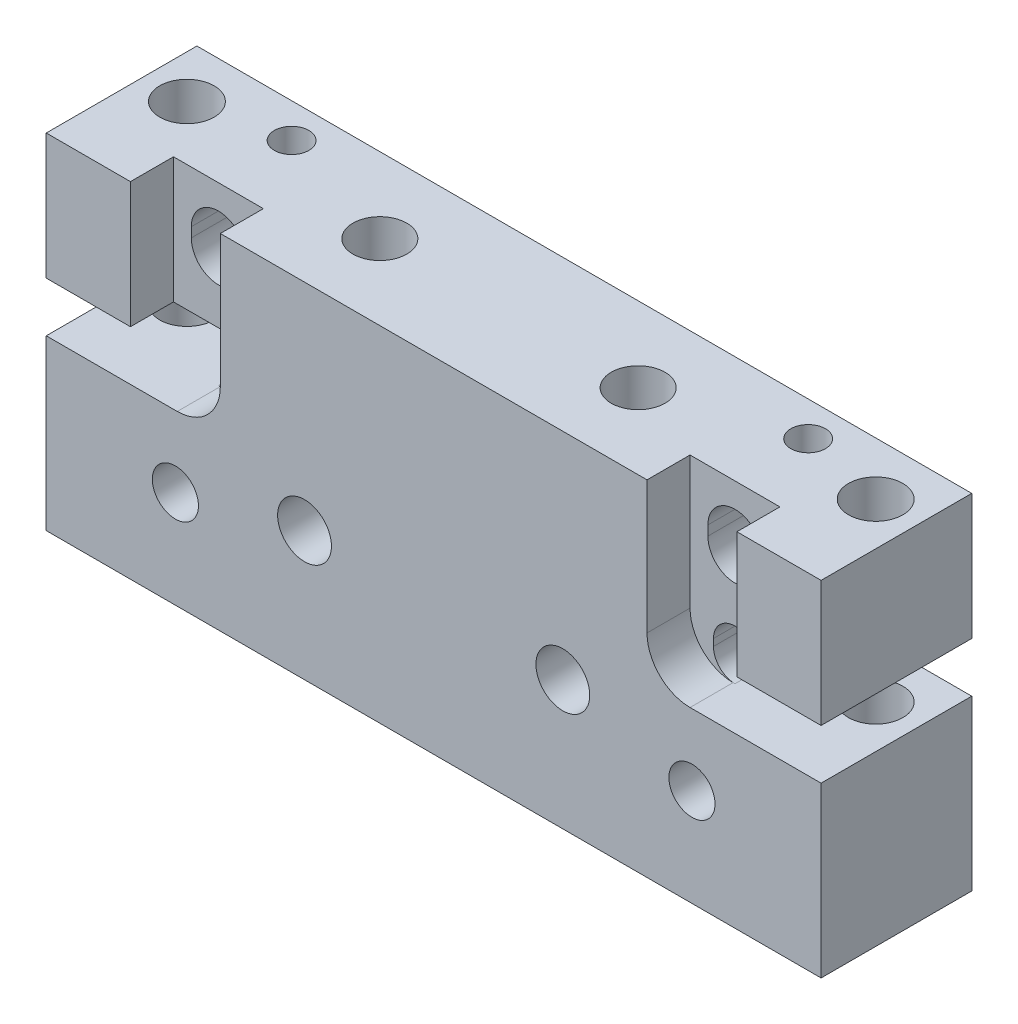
ISO-10303-21;
HEADER;
FILE_DESCRIPTION(('STEP AP214'),'2;1');
FILE_NAME('part.step','',(''),(''),'','','');
FILE_SCHEMA(('AUTOMOTIVE_DESIGN { 1 0 10303 214 1 1 1 1 }'));
ENDSEC;
DATA;
#1=APPLICATION_CONTEXT('core data for automotive mechanical design processes');
#2=APPLICATION_PROTOCOL_DEFINITION('international standard','automotive_design',2000,#1);
#3=PRODUCT_CONTEXT('',#1,'mechanical');
#4=PRODUCT('Part','Part','',(#3));
#5=PRODUCT_RELATED_PRODUCT_CATEGORY('part','',(#4));
#6=PRODUCT_DEFINITION_FORMATION('','',#4);
#7=PRODUCT_DEFINITION_CONTEXT('part definition',#1,'design');
#8=PRODUCT_DEFINITION('design','',#6,#7);
#9=PRODUCT_DEFINITION_SHAPE('','',#8);
#10=(LENGTH_UNIT() NAMED_UNIT(*) SI_UNIT(.MILLI.,.METRE.));
#11=(NAMED_UNIT(*) PLANE_ANGLE_UNIT() SI_UNIT($,.RADIAN.));
#12=(NAMED_UNIT(*) SI_UNIT($,.STERADIAN.) SOLID_ANGLE_UNIT());
#13=UNCERTAINTY_MEASURE_WITH_UNIT(LENGTH_MEASURE(1.E-05),#10,'distance_accuracy_value','');
#14=(GEOMETRIC_REPRESENTATION_CONTEXT(3) GLOBAL_UNCERTAINTY_ASSIGNED_CONTEXT((#13)) GLOBAL_UNIT_ASSIGNED_CONTEXT((#10,
#11,#12)) REPRESENTATION_CONTEXT('',''));
#15=CARTESIAN_POINT('',(0.,0.,0.));
#16=DIRECTION('',(0.,0.,1.));
#17=DIRECTION('',(1.,0.,0.));
#18=AXIS2_PLACEMENT_3D('',#15,#16,#17);
#19=CARTESIAN_POINT('',(0.,50.8,22.225));
#20=DIRECTION('',(0.,-1.,0.));
#21=DIRECTION('',(0.,0.,-1.));
#22=AXIS2_PLACEMENT_3D('',#19,#20,#21);
#23=PLANE('',#22);
#24=CARTESIAN_POINT('',(6.34999999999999,50.8,7.8232));
#25=DIRECTION('',(0.,1.,0.));
#26=DIRECTION('',(0.,0.,1.));
#27=AXIS2_PLACEMENT_3D('',#24,#25,#26);
#28=CIRCLE('',#27,4.01319999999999);
#29=CARTESIAN_POINT('',(6.34999999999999,50.8,11.8364));
#30=VERTEX_POINT('',#29);
#31=EDGE_CURVE('E1293',#30,#30,#28,.T.);
#32=ORIENTED_EDGE('',*,*,#31,.F.);
#33=EDGE_LOOP('',(#32));
#34=FACE_BOUND('',#33,.T.);
#35=CARTESIAN_POINT('',(107.95,50.8,7.8232));
#36=DIRECTION('',(0.,1.,0.));
#37=DIRECTION('',(0.,0.,1.));
#38=AXIS2_PLACEMENT_3D('',#35,#36,#37);
#39=CIRCLE('',#38,4.01319999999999);
#40=CARTESIAN_POINT('',(107.95,50.8,11.8364));
#41=VERTEX_POINT('',#40);
#42=EDGE_CURVE('E286',#41,#41,#39,.T.);
#43=ORIENTED_EDGE('',*,*,#42,.F.);
#44=EDGE_LOOP('',(#43));
#45=FACE_BOUND('',#44,.T.);
#46=CARTESIAN_POINT('',(19.05,50.8,5.08));
#47=DIRECTION('',(0.,1.,0.));
#48=DIRECTION('',(0.,0.,1.));
#49=AXIS2_PLACEMENT_3D('',#46,#47,#48);
#50=CIRCLE('',#49,2.55269999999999);
#51=CARTESIAN_POINT('',(19.05,50.8,7.63269999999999));
#52=VERTEX_POINT('',#51);
#53=EDGE_CURVE('E311',#52,#52,#50,.T.);
#54=ORIENTED_EDGE('',*,*,#53,.F.);
#55=EDGE_LOOP('',(#54));
#56=FACE_BOUND('',#55,.T.);
#57=CARTESIAN_POINT('',(76.2,50.8,11.1125));
#58=DIRECTION('',(0.,1.,0.));
#59=DIRECTION('',(0.,0.,1.));
#60=AXIS2_PLACEMENT_3D('',#57,#58,#59);
#61=CIRCLE('',#60,3.96874999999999);
#62=CARTESIAN_POINT('',(76.2,50.8,15.08125));
#63=VERTEX_POINT('',#62);
#64=EDGE_CURVE('E849',#63,#63,#61,.T.);
#65=ORIENTED_EDGE('',*,*,#64,.F.);
#66=EDGE_LOOP('',(#65));
#67=FACE_BOUND('',#66,.T.);
#68=CARTESIAN_POINT('',(38.1,50.8,11.1125));
#69=DIRECTION('',(0.,1.,0.));
#70=DIRECTION('',(0.,0.,1.));
#71=AXIS2_PLACEMENT_3D('',#68,#69,#70);
#72=CIRCLE('',#71,3.96874999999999);
#73=CARTESIAN_POINT('',(38.1,50.8,15.08125));
#74=VERTEX_POINT('',#73);
#75=EDGE_CURVE('E834',#74,#74,#72,.T.);
#76=ORIENTED_EDGE('',*,*,#75,.F.);
#77=EDGE_LOOP('',(#76));
#78=FACE_BOUND('',#77,.T.);
#79=DIRECTION('',(-1.,0.,0.));
#80=VECTOR('',#79,1.);
#81=CARTESIAN_POINT('',(0.,50.8,22.225));
#82=LINE('',#81,#80);
#83=CARTESIAN_POINT('',(12.4206,50.8,22.225));
#84=VERTEX_POINT('',#83);
#85=CARTESIAN_POINT('',(0.,50.8,22.225));
#86=VERTEX_POINT('',#85);
#87=EDGE_CURVE('E595',#84,#86,#82,.T.);
#88=ORIENTED_EDGE('',*,*,#87,.F.);
#89=DIRECTION('',(0.,0.,1.));
#90=VECTOR('',#89,1.);
#91=CARTESIAN_POINT('',(12.4206,50.8,15.875));
#92=LINE('',#91,#90);
#93=CARTESIAN_POINT('',(12.4206,50.8,15.875));
#94=VERTEX_POINT('',#93);
#95=EDGE_CURVE('E822',#94,#84,#92,.T.);
#96=ORIENTED_EDGE('',*,*,#95,.F.);
#97=DIRECTION('',(-1.,0.,0.));
#98=VECTOR('',#97,1.);
#99=CARTESIAN_POINT('',(25.6794,50.8,15.875));
#100=LINE('',#99,#98);
#101=CARTESIAN_POINT('',(25.6794,50.8,15.875));
#102=VERTEX_POINT('',#101);
#103=EDGE_CURVE('E839',#102,#94,#100,.T.);
#104=ORIENTED_EDGE('',*,*,#103,.F.);
#105=DIRECTION('',(0.,0.,1.));
#106=VECTOR('',#105,1.);
#107=CARTESIAN_POINT('',(25.6794,50.8,15.875));
#108=LINE('',#107,#106);
#109=CARTESIAN_POINT('',(25.6794,50.8,22.225));
#110=VERTEX_POINT('',#109);
#111=EDGE_CURVE('E818',#102,#110,#108,.T.);
#112=ORIENTED_EDGE('',*,*,#111,.T.);
#113=CARTESIAN_POINT('',(88.6206,50.8,22.225));
#114=VERTEX_POINT('',#113);
#115=EDGE_CURVE('E593',#114,#110,#82,.T.);
#116=ORIENTED_EDGE('',*,*,#115,.F.);
#117=DIRECTION('',(0.,0.,1.));
#118=VECTOR('',#117,1.);
#119=CARTESIAN_POINT('',(88.6206,50.8,15.875));
#120=LINE('',#119,#118);
#121=CARTESIAN_POINT('',(88.6206,50.8,15.875));
#122=VERTEX_POINT('',#121);
#123=EDGE_CURVE('E762',#122,#114,#120,.T.);
#124=ORIENTED_EDGE('',*,*,#123,.F.);
#125=DIRECTION('',(-1.,0.,0.));
#126=VECTOR('',#125,1.);
#127=CARTESIAN_POINT('',(88.6206,50.8,15.875));
#128=LINE('',#127,#126);
#129=CARTESIAN_POINT('',(101.8794,50.8,15.875));
#130=VERTEX_POINT('',#129);
#131=EDGE_CURVE('E766',#130,#122,#128,.T.);
#132=ORIENTED_EDGE('',*,*,#131,.F.);
#133=DIRECTION('',(0.,0.,1.));
#134=VECTOR('',#133,1.);
#135=CARTESIAN_POINT('',(101.8794,50.8,15.875));
#136=LINE('',#135,#134);
#137=CARTESIAN_POINT('',(101.8794,50.8,22.225));
#138=VERTEX_POINT('',#137);
#139=EDGE_CURVE('E769',#130,#138,#136,.T.);
#140=ORIENTED_EDGE('',*,*,#139,.T.);
#141=CARTESIAN_POINT('',(114.3,50.8,22.225));
#142=VERTEX_POINT('',#141);
#143=EDGE_CURVE('E417',#142,#138,#82,.T.);
#144=ORIENTED_EDGE('',*,*,#143,.F.);
#145=DIRECTION('',(0.,0.,-1.));
#146=VECTOR('',#145,1.);
#147=CARTESIAN_POINT('',(114.3,50.8,22.225));
#148=LINE('',#147,#146);
#149=CARTESIAN_POINT('',(114.3,50.8,0.));
#150=VERTEX_POINT('',#149);
#151=EDGE_CURVE('E400',#142,#150,#148,.T.);
#152=ORIENTED_EDGE('',*,*,#151,.T.);
#153=DIRECTION('',(-1.,0.,0.));
#154=VECTOR('',#153,1.);
#155=CARTESIAN_POINT('',(0.,50.8,0.));
#156=LINE('',#155,#154);
#157=CARTESIAN_POINT('',(0.,50.8,0.));
#158=VERTEX_POINT('',#157);
#159=EDGE_CURVE('E408',#150,#158,#156,.T.);
#160=ORIENTED_EDGE('',*,*,#159,.T.);
#161=DIRECTION('',(0.,0.,-1.));
#162=VECTOR('',#161,1.);
#163=CARTESIAN_POINT('',(0.,50.8,22.225));
#164=LINE('',#163,#162);
#165=EDGE_CURVE('E414',#86,#158,#164,.T.);
#166=ORIENTED_EDGE('',*,*,#165,.F.);
#167=EDGE_LOOP('',(#88,#96,#104,#112,#116,#124,#132,#140,#144,#152,#160,#166));
#168=FACE_BOUND('',#167,.T.);
#169=CARTESIAN_POINT('',(95.25,50.8,5.08));
#170=DIRECTION('',(0.,1.,0.));
#171=DIRECTION('',(0.,0.,1.));
#172=AXIS2_PLACEMENT_3D('',#169,#170,#171);
#173=CIRCLE('',#172,2.55269999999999);
#174=CARTESIAN_POINT('',(95.25,50.8,7.63269999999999));
#175=VERTEX_POINT('',#174);
#176=EDGE_CURVE('E290',#175,#175,#173,.T.);
#177=ORIENTED_EDGE('',*,*,#176,.F.);
#178=EDGE_LOOP('',(#177));
#179=FACE_BOUND('',#178,.T.);
#180=ADVANCED_FACE('F34',(#34,#45,#56,#67,#78,#168,#179),#23,.F.);
#181=CARTESIAN_POINT('',(76.2,19.05,22.225));
#182=DIRECTION('',(0.,0.,1.));
#183=DIRECTION('',(1.,0.,0.));
#184=AXIS2_PLACEMENT_3D('',#181,#182,#183);
#185=CYLINDRICAL_SURFACE('',#184,3.96874999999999);
#186=CARTESIAN_POINT('',(76.2,19.05,22.225));
#187=DIRECTION('',(0.,0.,1.));
#188=DIRECTION('',(1.,0.,0.));
#189=AXIS2_PLACEMENT_3D('',#186,#187,#188);
#190=CIRCLE('',#189,3.96874999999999);
#191=CARTESIAN_POINT('',(80.16875,19.05,22.225));
#192=VERTEX_POINT('',#191);
#193=EDGE_CURVE('E688',#192,#192,#190,.T.);
#194=ORIENTED_EDGE('',*,*,#193,.T.);
#195=EDGE_LOOP('',(#194));
#196=FACE_BOUND('',#195,.T.);
#197=CARTESIAN_POINT('',(76.2,19.05,11.1125));
#198=DIRECTION('',(0.,-0.707106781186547,0.707106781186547));
#199=DIRECTION('',(0.,0.707106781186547,0.707106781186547));
#200=AXIS2_PLACEMENT_3D('',#197,#198,#199);
#201=ELLIPSE('',#200,5.61266007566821,3.96874999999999);
#202=CARTESIAN_POINT('',(72.23125,19.05,11.1125));
#203=VERTEX_POINT('',#202);
#204=CARTESIAN_POINT('',(80.16875,19.05,11.1125));
#205=VERTEX_POINT('',#204);
#206=EDGE_CURVE('E49',#203,#205,#201,.F.);
#207=ORIENTED_EDGE('',*,*,#206,.T.);
#208=CARTESIAN_POINT('',(76.2,19.05,11.1125));
#209=DIRECTION('',(0.,0.707106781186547,0.707106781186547));
#210=DIRECTION('',(0.,-0.707106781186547,0.707106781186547));
#211=AXIS2_PLACEMENT_3D('',#208,#209,#210);
#212=ELLIPSE('',#211,5.61266007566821,3.96874999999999);
#213=EDGE_CURVE('E11',#205,#203,#212,.F.);
#214=ORIENTED_EDGE('',*,*,#213,.T.);
#215=EDGE_LOOP('',(#207,#214));
#216=FACE_BOUND('',#215,.T.);
#217=ADVANCED_FACE('F279',(#196,#216),#185,.F.);
#218=CARTESIAN_POINT('',(38.1,19.05,22.225));
#219=DIRECTION('',(0.,0.,1.));
#220=DIRECTION('',(1.,0.,0.));
#221=AXIS2_PLACEMENT_3D('',#218,#219,#220);
#222=CYLINDRICAL_SURFACE('',#221,3.96874999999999);
#223=CARTESIAN_POINT('',(38.1,19.05,22.225));
#224=DIRECTION('',(0.,0.,1.));
#225=DIRECTION('',(1.,0.,0.));
#226=AXIS2_PLACEMENT_3D('',#223,#224,#225);
#227=CIRCLE('',#226,3.96874999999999);
#228=CARTESIAN_POINT('',(42.06875,19.05,22.225));
#229=VERTEX_POINT('',#228);
#230=EDGE_CURVE('E694',#229,#229,#227,.T.);
#231=ORIENTED_EDGE('',*,*,#230,.T.);
#232=EDGE_LOOP('',(#231));
#233=FACE_BOUND('',#232,.T.);
#234=CARTESIAN_POINT('',(38.1,19.05,11.1125));
#235=DIRECTION('',(0.,-0.707106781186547,0.707106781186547));
#236=DIRECTION('',(0.,0.707106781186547,0.707106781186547));
#237=AXIS2_PLACEMENT_3D('',#234,#235,#236);
#238=ELLIPSE('',#237,5.61266007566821,3.96874999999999);
#239=CARTESIAN_POINT('',(34.13125,19.05,11.1125));
#240=VERTEX_POINT('',#239);
#241=CARTESIAN_POINT('',(42.06875,19.05,11.1125));
#242=VERTEX_POINT('',#241);
#243=EDGE_CURVE('E56',#240,#242,#238,.F.);
#244=ORIENTED_EDGE('',*,*,#243,.T.);
#245=CARTESIAN_POINT('',(38.1,19.05,11.1125));
#246=DIRECTION('',(0.,0.707106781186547,0.707106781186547));
#247=DIRECTION('',(0.,-0.707106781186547,0.707106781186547));
#248=AXIS2_PLACEMENT_3D('',#245,#246,#247);
#249=ELLIPSE('',#248,5.61266007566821,3.96874999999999);
#250=EDGE_CURVE('E277',#242,#240,#249,.F.);
#251=ORIENTED_EDGE('',*,*,#250,.T.);
#252=EDGE_LOOP('',(#244,#251));
#253=FACE_BOUND('',#252,.T.);
#254=ADVANCED_FACE('F342',(#233,#253),#222,.F.);
#255=CARTESIAN_POINT('',(0.,50.8,22.225));
#256=DIRECTION('',(0.,0.,-1.));
#257=DIRECTION('',(-1.,0.,0.));
#258=AXIS2_PLACEMENT_3D('',#255,#256,#257);
#259=PLANE('',#258);
#260=DIRECTION('',(-1.,0.,0.));
#261=VECTOR('',#260,1.);
#262=CARTESIAN_POINT('',(0.,32.258,22.225));
#263=LINE('',#262,#261);
#264=CARTESIAN_POINT('',(12.4206,32.258,22.225));
#265=VERTEX_POINT('',#264);
#266=CARTESIAN_POINT('',(0.,32.258,22.225));
#267=VERTEX_POINT('',#266);
#268=EDGE_CURVE('E659',#265,#267,#263,.T.);
#269=ORIENTED_EDGE('',*,*,#268,.F.);
#270=DIRECTION('',(0.,-1.,0.));
#271=VECTOR('',#270,1.);
#272=CARTESIAN_POINT('',(12.4206,50.8,22.225));
#273=LINE('',#272,#271);
#274=EDGE_CURVE('E826',#84,#265,#273,.T.);
#275=ORIENTED_EDGE('',*,*,#274,.F.);
#276=ORIENTED_EDGE('',*,*,#87,.T.);
#277=DIRECTION('',(0.,-1.,0.));
#278=VECTOR('',#277,1.);
#279=CARTESIAN_POINT('',(0.,0.,22.225));
#280=LINE('',#279,#278);
#281=EDGE_CURVE('E606',#86,#267,#280,.T.);
#282=ORIENTED_EDGE('',*,*,#281,.T.);
#283=EDGE_LOOP('',(#269,#275,#276,#282));
#284=FACE_BOUND('',#283,.T.);
#285=ADVANCED_FACE('F571',(#284),#259,.F.);
#286=ORIENTED_EDGE('',*,*,#143,.T.);
#287=DIRECTION('',(0.,1.,0.));
#288=VECTOR('',#287,1.);
#289=CARTESIAN_POINT('',(101.8794,50.8,22.225));
#290=LINE('',#289,#288);
#291=CARTESIAN_POINT('',(101.8794,32.258,22.225));
#292=VERTEX_POINT('',#291);
#293=EDGE_CURVE('E586',#292,#138,#290,.T.);
#294=ORIENTED_EDGE('',*,*,#293,.F.);
#295=DIRECTION('',(-1.,0.,0.));
#296=VECTOR('',#295,1.);
#297=CARTESIAN_POINT('',(114.3,32.258,22.225));
#298=LINE('',#297,#296);
#299=CARTESIAN_POINT('',(114.3,32.258,22.225));
#300=VERTEX_POINT('',#299);
#301=EDGE_CURVE('E628',#300,#292,#298,.T.);
#302=ORIENTED_EDGE('',*,*,#301,.F.);
#303=DIRECTION('',(0.,1.,0.));
#304=VECTOR('',#303,1.);
#305=CARTESIAN_POINT('',(114.3,0.,22.225));
#306=LINE('',#305,#304);
#307=EDGE_CURVE('E589',#300,#142,#306,.T.);
#308=ORIENTED_EDGE('',*,*,#307,.T.);
#309=EDGE_LOOP('',(#286,#294,#302,#308));
#310=FACE_BOUND('',#309,.T.);
#311=ADVANCED_FACE('F560',(#310),#259,.F.);
#312=CARTESIAN_POINT('',(95.25,28.067,0.));
#313=DIRECTION('',(0.,0.,1.));
#314=DIRECTION('',(1.,0.,0.));
#315=AXIS2_PLACEMENT_3D('',#312,#313,#314);
#316=CYLINDRICAL_SURFACE('',#315,3.175);
#317=CARTESIAN_POINT('',(95.25,28.067,15.875));
#318=DIRECTION('',(0.,0.,1.));
#319=DIRECTION('',(1.,0.,0.));
#320=AXIS2_PLACEMENT_3D('',#317,#318,#319);
#321=CIRCLE('',#320,3.175);
#322=CARTESIAN_POINT('',(95.25,24.892,15.875));
#323=VERTEX_POINT('',#322);
#324=CARTESIAN_POINT('',(92.075,28.067,15.875));
#325=VERTEX_POINT('',#324);
#326=EDGE_CURVE('E748',#323,#325,#321,.F.);
#327=ORIENTED_EDGE('',*,*,#326,.F.);
#328=DIRECTION('',(0.,0.,1.));
#329=VECTOR('',#328,1.);
#330=CARTESIAN_POINT('',(95.25,24.892,0.));
#331=LINE('',#330,#329);
#332=CARTESIAN_POINT('',(95.25,24.892,0.));
#333=VERTEX_POINT('',#332);
#334=EDGE_CURVE('E619',#333,#323,#331,.T.);
#335=ORIENTED_EDGE('',*,*,#334,.F.);
#336=CARTESIAN_POINT('',(95.25,28.067,0.));
#337=DIRECTION('',(0.,0.,1.));
#338=DIRECTION('',(1.,0.,0.));
#339=AXIS2_PLACEMENT_3D('',#336,#337,#338);
#340=CIRCLE('',#339,3.175);
#341=CARTESIAN_POINT('',(92.075,28.067,0.));
#342=VERTEX_POINT('',#341);
#343=EDGE_CURVE('E632',#342,#333,#340,.T.);
#344=ORIENTED_EDGE('',*,*,#343,.F.);
#345=DIRECTION('',(0.,0.,1.));
#346=VECTOR('',#345,1.);
#347=CARTESIAN_POINT('',(92.075,28.067,0.));
#348=LINE('',#347,#346);
#349=EDGE_CURVE('E616',#342,#325,#348,.T.);
#350=ORIENTED_EDGE('',*,*,#349,.T.);
#351=EDGE_LOOP('',(#327,#335,#344,#350));
#352=FACE_BOUND('',#351,.T.);
#353=ADVANCED_FACE('F556',(#352),#316,.F.);
#354=CARTESIAN_POINT('',(92.075,29.083,0.));
#355=DIRECTION('',(-1.,0.,0.));
#356=DIRECTION('',(0.,0.,1.));
#357=AXIS2_PLACEMENT_3D('',#354,#355,#356);
#358=PLANE('',#357);
#359=DIRECTION('',(0.,1.,0.));
#360=VECTOR('',#359,1.);
#361=CARTESIAN_POINT('',(92.075,29.083,15.875));
#362=LINE('',#361,#360);
#363=CARTESIAN_POINT('',(92.075,29.083,15.875));
#364=VERTEX_POINT('',#363);
#365=EDGE_CURVE('E750',#325,#364,#362,.T.);
#366=ORIENTED_EDGE('',*,*,#365,.F.);
#367=ORIENTED_EDGE('',*,*,#349,.F.);
#368=DIRECTION('',(0.,-1.,0.));
#369=VECTOR('',#368,1.);
#370=CARTESIAN_POINT('',(92.075,29.083,0.));
#371=LINE('',#370,#369);
#372=CARTESIAN_POINT('',(92.075,29.083,0.));
#373=VERTEX_POINT('',#372);
#374=EDGE_CURVE('E634',#373,#342,#371,.T.);
#375=ORIENTED_EDGE('',*,*,#374,.F.);
#376=DIRECTION('',(0.,0.,1.));
#377=VECTOR('',#376,1.);
#378=CARTESIAN_POINT('',(92.075,29.083,0.));
#379=LINE('',#378,#377);
#380=EDGE_CURVE('E613',#373,#364,#379,.T.);
#381=ORIENTED_EDGE('',*,*,#380,.T.);
#382=EDGE_LOOP('',(#366,#367,#375,#381));
#383=FACE_BOUND('',#382,.T.);
#384=ADVANCED_FACE('F559',(#383),#358,.F.);
#385=CARTESIAN_POINT('',(95.25,29.083,0.));
#386=DIRECTION('',(0.,0.,1.));
#387=DIRECTION('',(1.,0.,0.));
#388=AXIS2_PLACEMENT_3D('',#385,#386,#387);
#389=CYLINDRICAL_SURFACE('',#388,3.175);
#390=CARTESIAN_POINT('',(95.25,29.083,15.875));
#391=DIRECTION('',(0.,0.,1.));
#392=DIRECTION('',(1.,0.,0.));
#393=AXIS2_PLACEMENT_3D('',#390,#391,#392);
#394=CIRCLE('',#393,3.175);
#395=CARTESIAN_POINT('',(95.25,32.258,15.875));
#396=VERTEX_POINT('',#395);
#397=EDGE_CURVE('E752',#364,#396,#394,.F.);
#398=ORIENTED_EDGE('',*,*,#397,.F.);
#399=ORIENTED_EDGE('',*,*,#380,.F.);
#400=CARTESIAN_POINT('',(95.25,29.083,0.));
#401=DIRECTION('',(0.,0.,1.));
#402=DIRECTION('',(-1.,0.,0.));
#403=AXIS2_PLACEMENT_3D('',#400,#401,#402);
#404=CIRCLE('',#403,3.175);
#405=CARTESIAN_POINT('',(95.25,32.258,0.));
#406=VERTEX_POINT('',#405);
#407=EDGE_CURVE('E637',#406,#373,#404,.T.);
#408=ORIENTED_EDGE('',*,*,#407,.F.);
#409=DIRECTION('',(0.,0.,1.));
#410=VECTOR('',#409,1.);
#411=CARTESIAN_POINT('',(95.25,32.258,0.));
#412=LINE('',#411,#410);
#413=EDGE_CURVE('E610',#406,#396,#412,.T.);
#414=ORIENTED_EDGE('',*,*,#413,.T.);
#415=EDGE_LOOP('',(#398,#399,#408,#414));
#416=FACE_BOUND('',#415,.T.);
#417=ADVANCED_FACE('F503',(#416),#389,.F.);
#418=CARTESIAN_POINT('',(95.25,41.75,0.));
#419=DIRECTION('',(0.,0.,1.));
#420=DIRECTION('',(1.,0.,0.));
#421=AXIS2_PLACEMENT_3D('',#418,#419,#420);
#422=CYLINDRICAL_SURFACE('',#421,4.);
#423=CARTESIAN_POINT('',(95.25,41.75,15.875));
#424=DIRECTION('',(0.,0.,1.));
#425=DIRECTION('',(1.,0.,0.));
#426=AXIS2_PLACEMENT_3D('',#423,#424,#425);
#427=CIRCLE('',#426,4.);
#428=CARTESIAN_POINT('',(99.25,41.75,15.875));
#429=VERTEX_POINT('',#428);
#430=CARTESIAN_POINT('',(91.25,41.75,15.875));
#431=VERTEX_POINT('',#430);
#432=EDGE_CURVE('E756',#429,#431,#427,.F.);
#433=ORIENTED_EDGE('',*,*,#432,.F.);
#434=DIRECTION('',(0.,0.,1.));
#435=VECTOR('',#434,1.);
#436=CARTESIAN_POINT('',(99.25,41.75,0.));
#437=LINE('',#436,#435);
#438=CARTESIAN_POINT('',(99.25,41.75,0.));
#439=VERTEX_POINT('',#438);
#440=EDGE_CURVE('E725',#439,#429,#437,.T.);
#441=ORIENTED_EDGE('',*,*,#440,.F.);
#442=CARTESIAN_POINT('',(95.25,41.75,0.));
#443=DIRECTION('',(0.,0.,1.));
#444=DIRECTION('',(1.,0.,0.));
#445=AXIS2_PLACEMENT_3D('',#442,#443,#444);
#446=CIRCLE('',#445,4.);
#447=CARTESIAN_POINT('',(91.25,41.75,0.));
#448=VERTEX_POINT('',#447);
#449=EDGE_CURVE('E745',#448,#439,#446,.T.);
#450=ORIENTED_EDGE('',*,*,#449,.F.);
#451=DIRECTION('',(0.,0.,1.));
#452=VECTOR('',#451,1.);
#453=CARTESIAN_POINT('',(91.25,41.75,0.));
#454=LINE('',#453,#452);
#455=EDGE_CURVE('E724',#448,#431,#454,.T.);
#456=ORIENTED_EDGE('',*,*,#455,.T.);
#457=EDGE_LOOP('',(#433,#441,#450,#456));
#458=FACE_BOUND('',#457,.T.);
#459=ADVANCED_FACE('F492',(#458),#422,.F.);
#460=CARTESIAN_POINT('',(91.25,41.75,0.));
#461=DIRECTION('',(-1.,0.,0.));
#462=DIRECTION('',(0.,0.,1.));
#463=AXIS2_PLACEMENT_3D('',#460,#461,#462);
#464=PLANE('',#463);
#465=DIRECTION('',(0.,1.,0.));
#466=VECTOR('',#465,1.);
#467=CARTESIAN_POINT('',(91.25,41.75,15.875));
#468=LINE('',#467,#466);
#469=CARTESIAN_POINT('',(91.25,43.18,15.875));
#470=VERTEX_POINT('',#469);
#471=EDGE_CURVE('E758',#431,#470,#468,.T.);
#472=ORIENTED_EDGE('',*,*,#471,.F.);
#473=ORIENTED_EDGE('',*,*,#455,.F.);
#474=DIRECTION('',(0.,-1.,0.));
#475=VECTOR('',#474,1.);
#476=CARTESIAN_POINT('',(91.25,41.75,0.));
#477=LINE('',#476,#475);
#478=CARTESIAN_POINT('',(91.25,43.18,0.));
#479=VERTEX_POINT('',#478);
#480=EDGE_CURVE('E729',#479,#448,#477,.T.);
#481=ORIENTED_EDGE('',*,*,#480,.F.);
#482=DIRECTION('',(0.,0.,1.));
#483=VECTOR('',#482,1.);
#484=CARTESIAN_POINT('',(91.25,43.18,0.));
#485=LINE('',#484,#483);
#486=EDGE_CURVE('E732',#479,#470,#485,.T.);
#487=ORIENTED_EDGE('',*,*,#486,.T.);
#488=EDGE_LOOP('',(#472,#473,#481,#487));
#489=FACE_BOUND('',#488,.T.);
#490=ADVANCED_FACE('F488',(#489),#464,.F.);
#491=CARTESIAN_POINT('',(95.25,43.18,0.));
#492=DIRECTION('',(0.,0.,1.));
#493=DIRECTION('',(1.,0.,0.));
#494=AXIS2_PLACEMENT_3D('',#491,#492,#493);
#495=CYLINDRICAL_SURFACE('',#494,4.);
#496=CARTESIAN_POINT('',(95.25,47.18,7.6327));
#497=CARTESIAN_POINT('',(95.3792115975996,47.1799899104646,7.63268902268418));
#498=CARTESIAN_POINT('',(95.5085635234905,47.1736742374,7.62282276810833));
#499=CARTESIAN_POINT('',(95.7632642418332,47.1490063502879,7.58389807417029));
#500=CARTESIAN_POINT('',(95.8886058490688,47.1306336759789,7.55480701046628));
#501=CARTESIAN_POINT('',(96.1311168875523,47.0836927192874,7.47915978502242));
#502=CARTESIAN_POINT('',(96.2483235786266,47.0551751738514,7.43269047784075));
#503=CARTESIAN_POINT('',(96.4728441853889,46.9902925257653,7.32421314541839));
#504=CARTESIAN_POINT('',(96.5801587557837,46.953927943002,7.26220614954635));
#505=CARTESIAN_POINT('',(96.7917458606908,46.8728144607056,7.11885702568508));
#506=CARTESIAN_POINT('',(96.8950567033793,46.8276236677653,7.03635052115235));
#507=CARTESIAN_POINT('',(97.0873024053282,46.73467979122,6.85705064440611));
#508=CARTESIAN_POINT('',(97.1762170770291,46.6869232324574,6.7602375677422));
#509=CARTESIAN_POINT('',(97.3500508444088,46.5860601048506,6.53897100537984));
#510=CARTESIAN_POINT('',(97.4325984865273,46.5331599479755,6.41254467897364));
#511=CARTESIAN_POINT('',(97.5750717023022,46.4359935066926,6.14454082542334));
#512=CARTESIAN_POINT('',(97.6350360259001,46.3917124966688,6.00298979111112));
#513=CARTESIAN_POINT('',(97.7165440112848,46.3292947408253,5.74729823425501));
#514=CARTESIAN_POINT('',(97.7440815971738,46.3073302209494,5.63601007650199));
#515=CARTESIAN_POINT('',(97.7839975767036,46.2750824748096,5.40916171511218));
#516=CARTESIAN_POINT('',(97.7963988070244,46.2647816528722,5.29360821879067));
#517=CARTESIAN_POINT('',(97.8052870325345,46.2574258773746,5.06109887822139));
#518=CARTESIAN_POINT('',(97.8017257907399,46.2604110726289,4.94413985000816));
#519=CARTESIAN_POINT('',(97.7788289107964,46.2792300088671,4.71279641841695));
#520=CARTESIAN_POINT('',(97.7594802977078,46.2950743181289,4.5984142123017));
#521=CARTESIAN_POINT('',(97.7069430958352,46.3366591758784,4.37847229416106));
#522=CARTESIAN_POINT('',(97.6741706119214,46.3621005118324,4.27275314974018));
#523=CARTESIAN_POINT('',(97.5961479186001,46.420053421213,4.06813435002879));
#524=CARTESIAN_POINT('',(97.5508935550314,46.4525673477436,3.96923697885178));
#525=CARTESIAN_POINT('',(97.4391907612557,46.5285563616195,3.76080728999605));
#526=CARTESIAN_POINT('',(97.3703391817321,46.5729365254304,3.65289432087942));
#527=CARTESIAN_POINT('',(97.2177753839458,46.6636410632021,3.44893163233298));
#528=CARTESIAN_POINT('',(97.134045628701,46.7099676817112,3.35289614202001));
#529=CARTESIAN_POINT('',(96.9363613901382,46.8091191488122,3.15774386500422));
#530=CARTESIAN_POINT('',(96.8196792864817,46.8616105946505,3.06119049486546));
#531=CARTESIAN_POINT('',(96.5688408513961,46.9587145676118,2.88911109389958));
#532=CARTESIAN_POINT('',(96.4347035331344,47.0033355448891,2.81356246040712));
#533=CARTESIAN_POINT('',(96.179989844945,47.0721620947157,2.69949012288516));
#534=CARTESIAN_POINT('',(96.0619901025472,47.0986608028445,2.65659675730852));
#535=CARTESIAN_POINT('',(95.8192247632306,47.1412024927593,2.58839004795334));
#536=CARTESIAN_POINT('',(95.6944646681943,47.1572538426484,2.56306263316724));
#537=CARTESIAN_POINT('',(95.4411653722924,47.1774545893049,2.53126033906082));
#538=CARTESIAN_POINT('',(95.3126151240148,47.181564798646,2.52484753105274));
#539=CARTESIAN_POINT('',(95.0562117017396,47.1773597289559,2.53143786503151));
#540=CARTESIAN_POINT('',(94.9283585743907,47.1690436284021,2.54444229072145));
#541=CARTESIAN_POINT('',(94.6838883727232,47.1415497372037,2.58792948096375));
#542=CARTESIAN_POINT('',(94.56703283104,47.1229597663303,2.6174673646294));
#543=CARTESIAN_POINT('',(94.3402300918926,47.0768864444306,2.69193496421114));
#544=CARTESIAN_POINT('',(94.2302840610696,47.0494015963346,2.7368672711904));
#545=CARTESIAN_POINT('',(94.0113132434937,46.9852114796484,2.8443987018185));
#546=CARTESIAN_POINT('',(93.9029761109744,46.9479692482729,2.90807016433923));
#547=CARTESIAN_POINT('',(93.6979943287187,46.8682783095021,3.04946189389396));
#548=CARTESIAN_POINT('',(93.6013589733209,46.8258255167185,3.1271932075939));
#549=CARTESIAN_POINT('',(93.4070815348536,46.7320381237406,3.30796097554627));
#550=CARTESIAN_POINT('',(93.311521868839,46.680334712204,3.41304806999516));
#551=CARTESIAN_POINT('',(93.1386717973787,46.5788731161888,3.63822585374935));
#552=CARTESIAN_POINT('',(93.0613844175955,46.5291152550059,3.75831902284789));
#553=CARTESIAN_POINT('',(92.936349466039,46.4437302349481,3.99437825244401));
#554=CARTESIAN_POINT('',(92.8859877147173,46.4071002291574,4.10859250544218));
#555=CARTESIAN_POINT('',(92.8019802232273,46.3438580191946,4.34569450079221));
#556=CARTESIAN_POINT('',(92.7683111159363,46.3172318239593,4.4685698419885));
#557=CARTESIAN_POINT('',(92.7316296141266,46.2877399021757,4.65775315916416));
#558=CARTESIAN_POINT('',(92.7216910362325,46.2796359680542,4.72197601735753));
#559=CARTESIAN_POINT('',(92.7067287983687,46.2673725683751,4.85135218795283));
#560=CARTESIAN_POINT('',(92.7017026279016,46.2632110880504,4.91650500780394));
#561=CARTESIAN_POINT('',(92.696675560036,46.2590494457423,5.04711768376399));
#562=CARTESIAN_POINT('',(92.6966730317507,46.2590479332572,5.11257743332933));
#563=CARTESIAN_POINT('',(92.7016802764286,46.263192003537,5.24315245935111));
#564=CARTESIAN_POINT('',(92.7066896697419,46.2673372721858,5.30826776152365));
#565=CARTESIAN_POINT('',(92.7269876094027,46.28398268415,5.48389371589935));
#566=CARTESIAN_POINT('',(92.7470675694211,46.3003395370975,5.59353130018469));
#567=CARTESIAN_POINT('',(92.8006660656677,46.3425784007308,5.80750339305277));
#568=CARTESIAN_POINT('',(92.8341977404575,46.3684697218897,5.91183260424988));
#569=CARTESIAN_POINT('',(92.9271311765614,46.4370928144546,6.14856223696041));
#570=CARTESIAN_POINT('',(92.9914664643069,46.4825530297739,6.27823818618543));
#571=CARTESIAN_POINT('',(93.1397429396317,46.5792130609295,6.52349950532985));
#572=CARTESIAN_POINT('',(93.2237105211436,46.6304205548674,6.63906558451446));
#573=CARTESIAN_POINT('',(93.4106347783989,46.7336293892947,6.85587451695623));
#574=CARTESIAN_POINT('',(93.5137979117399,46.7856331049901,6.95693817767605));
#575=CARTESIAN_POINT('',(93.7371983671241,46.8849055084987,7.14121925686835));
#576=CARTESIAN_POINT('',(93.8574358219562,46.932174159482,7.22443653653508));
#577=CARTESIAN_POINT('',(94.0507982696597,46.9966404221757,7.33475790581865));
#578=CARTESIAN_POINT('',(94.1185056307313,47.0173072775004,7.36950765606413));
#579=CARTESIAN_POINT('',(94.2574620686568,47.0555707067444,7.43307739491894));
#580=CARTESIAN_POINT('',(94.3287090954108,47.0731690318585,7.46190076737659));
#581=CARTESIAN_POINT('',(94.4740549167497,47.1047200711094,7.51312770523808));
#582=CARTESIAN_POINT('',(94.5481463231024,47.1186815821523,7.53554677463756));
#583=CARTESIAN_POINT('',(94.6986353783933,47.1425489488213,7.57365043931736));
#584=CARTESIAN_POINT('',(94.7750313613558,47.1524576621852,7.5893397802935));
#585=CARTESIAN_POINT('',(94.9177490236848,47.1667215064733,7.61185494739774));
#586=CARTESIAN_POINT('',(94.9838561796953,47.1716880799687,7.6196594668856));
#587=CARTESIAN_POINT('',(95.1166297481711,47.1783299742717,7.63008489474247));
#588=CARTESIAN_POINT('',(95.1832961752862,47.1800052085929,7.63270566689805));
#589=CARTESIAN_POINT('',(95.25,47.18,7.6327));
#590=B_SPLINE_CURVE_WITH_KNOTS('',3,(#496,#497,#498,#499,#500,#501,#502,#503,#504,#505,#506,
#507,#508,#509,#510,#511,#512,#513,#514,#515,#516,#517,#518,#519,#520,#521,#522,#523,#524,#525,
#526,#527,#528,#529,#530,#531,#532,#533,#534,#535,#536,#537,#538,#539,#540,#541,#542,#543,#544,
#545,#546,#547,#548,#549,#550,#551,#552,#553,#554,#555,#556,#557,#558,#559,#560,#561,#562,#563,
#564,#565,#566,#567,#568,#569,#570,#571,#572,#573,#574,#575,#576,#577,#578,#579,#580,#581,#582,
#583,#584,#585,#586,#587,#588,#589),.UNSPECIFIED.,.T.,.F.,(4,2,2,2,2,2,2,2,2,2,2,2,2,2,2,2,2,2,
2,2,2,2,2,2,2,2,2,2,2,2,2,2,2,2,2,2,2,2,2,2,2,2,2,2,2,2,4),(0.,0.387367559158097,
0.775394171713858,1.16150683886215,1.54759393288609,1.96516508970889,2.38331682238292,
2.86100613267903,3.33787201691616,3.68662728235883,4.03485571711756,4.38413717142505,
4.73370597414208,5.0731729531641,5.4127530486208,5.81772470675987,6.22317691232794,
6.70169415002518,7.17969445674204,7.56301475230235,7.94602763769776,8.33029605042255,
8.71458986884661,9.07888319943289,9.44323787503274,9.83492154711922,10.2269143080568,
10.6785283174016,11.1302170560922,11.5190415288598,11.9073201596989,12.1035296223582,
12.29963875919,12.4956842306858,12.6917148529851,13.0280804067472,13.3647752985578,
13.8175628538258,14.270962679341,14.7295550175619,15.1881509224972,15.4244312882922,
15.6605763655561,15.8961448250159,16.1315468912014,16.3315151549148,16.5314886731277),.UNSPECIFIED.);
#591=CARTESIAN_POINT('',(95.25,47.18,7.6327));
#592=VERTEX_POINT('',#591);
#593=EDGE_CURVE('E304',#592,#592,#590,.T.);
#594=ORIENTED_EDGE('',*,*,#593,.T.);
#595=EDGE_LOOP('',(#594));
#596=FACE_BOUND('',#595,.T.);
#597=CARTESIAN_POINT('',(95.25,43.18,15.875));
#598=DIRECTION('',(0.,0.,1.));
#599=DIRECTION('',(1.,0.,0.));
#600=AXIS2_PLACEMENT_3D('',#597,#598,#599);
#601=CIRCLE('',#600,4.);
#602=CARTESIAN_POINT('',(99.25,43.18,15.875));
#603=VERTEX_POINT('',#602);
#604=EDGE_CURVE('E760',#470,#603,#601,.F.);
#605=ORIENTED_EDGE('',*,*,#604,.F.);
#606=ORIENTED_EDGE('',*,*,#486,.F.);
#607=CARTESIAN_POINT('',(95.25,43.18,0.));
#608=DIRECTION('',(0.,0.,1.));
#609=DIRECTION('',(1.,0.,0.));
#610=AXIS2_PLACEMENT_3D('',#607,#608,#609);
#611=CIRCLE('',#610,4.);
#612=CARTESIAN_POINT('',(99.25,43.18,0.));
#613=VERTEX_POINT('',#612);
#614=EDGE_CURVE('E739',#613,#479,#611,.T.);
#615=ORIENTED_EDGE('',*,*,#614,.F.);
#616=DIRECTION('',(0.,0.,1.));
#617=VECTOR('',#616,1.);
#618=CARTESIAN_POINT('',(99.25,43.18,0.));
#619=LINE('',#618,#617);
#620=EDGE_CURVE('E728',#613,#603,#619,.T.);
#621=ORIENTED_EDGE('',*,*,#620,.T.);
#622=EDGE_LOOP('',(#605,#606,#615,#621));
#623=FACE_BOUND('',#622,.T.);
#624=ADVANCED_FACE('F491',(#596,#623),#495,.F.);
#625=CARTESIAN_POINT('',(99.25,41.75,0.));
#626=DIRECTION('',(1.,0.,0.));
#627=DIRECTION('',(0.,0.,-1.));
#628=AXIS2_PLACEMENT_3D('',#625,#626,#627);
#629=PLANE('',#628);
#630=DIRECTION('',(0.,-1.,0.));
#631=VECTOR('',#630,1.);
#632=CARTESIAN_POINT('',(99.25,41.75,15.875));
#633=LINE('',#632,#631);
#634=EDGE_CURVE('E421',#603,#429,#633,.T.);
#635=ORIENTED_EDGE('',*,*,#634,.F.);
#636=ORIENTED_EDGE('',*,*,#620,.F.);
#637=DIRECTION('',(0.,1.,0.));
#638=VECTOR('',#637,1.);
#639=CARTESIAN_POINT('',(99.25,41.75,0.));
#640=LINE('',#639,#638);
#641=EDGE_CURVE('E742',#439,#613,#640,.T.);
#642=ORIENTED_EDGE('',*,*,#641,.F.);
#643=ORIENTED_EDGE('',*,*,#440,.T.);
#644=EDGE_LOOP('',(#635,#636,#642,#643));
#645=FACE_BOUND('',#644,.T.);
#646=ADVANCED_FACE('F496',(#645),#629,.F.);
#647=CARTESIAN_POINT('',(0.,50.8,0.));
#648=DIRECTION('',(0.,0.,-1.));
#649=DIRECTION('',(-1.,0.,0.));
#650=AXIS2_PLACEMENT_3D('',#647,#648,#649);
#651=PLANE('',#650);
#652=ORIENTED_EDGE('',*,*,#449,.T.);
#653=ORIENTED_EDGE('',*,*,#641,.T.);
#654=ORIENTED_EDGE('',*,*,#614,.T.);
#655=ORIENTED_EDGE('',*,*,#480,.T.);
#656=EDGE_LOOP('',(#652,#653,#654,#655));
#657=FACE_BOUND('',#656,.T.);
#658=CARTESIAN_POINT('',(19.05,43.18,0.));
#659=DIRECTION('',(0.,0.,1.));
#660=DIRECTION('',(-1.,0.,0.));
#661=AXIS2_PLACEMENT_3D('',#658,#659,#660);
#662=CIRCLE('',#661,4.);
#663=CARTESIAN_POINT('',(23.05,43.18,0.));
#664=VERTEX_POINT('',#663);
#665=CARTESIAN_POINT('',(15.05,43.18,0.));
#666=VERTEX_POINT('',#665);
#667=EDGE_CURVE('E721',#664,#666,#662,.T.);
#668=ORIENTED_EDGE('',*,*,#667,.T.);
#669=DIRECTION('',(0.,-1.,0.));
#670=VECTOR('',#669,1.);
#671=CARTESIAN_POINT('',(15.05,41.75,0.));
#672=LINE('',#671,#670);
#673=CARTESIAN_POINT('',(15.05,41.75,0.));
#674=VERTEX_POINT('',#673);
#675=EDGE_CURVE('E718',#666,#674,#672,.T.);
#676=ORIENTED_EDGE('',*,*,#675,.T.);
#677=CARTESIAN_POINT('',(19.05,41.75,0.));
#678=DIRECTION('',(0.,0.,1.));
#679=DIRECTION('',(-1.,0.,0.));
#680=AXIS2_PLACEMENT_3D('',#677,#678,#679);
#681=CIRCLE('',#680,4.);
#682=CARTESIAN_POINT('',(23.05,41.75,0.));
#683=VERTEX_POINT('',#682);
#684=EDGE_CURVE('E715',#674,#683,#681,.T.);
#685=ORIENTED_EDGE('',*,*,#684,.T.);
#686=DIRECTION('',(0.,1.,0.));
#687=VECTOR('',#686,1.);
#688=CARTESIAN_POINT('',(23.05,41.75,0.));
#689=LINE('',#688,#687);
#690=EDGE_CURVE('E705',#683,#664,#689,.T.);
#691=ORIENTED_EDGE('',*,*,#690,.T.);
#692=EDGE_LOOP('',(#668,#676,#685,#691));
#693=FACE_BOUND('',#692,.T.);
#694=CARTESIAN_POINT('',(95.25,14.4,0.));
#695=DIRECTION('',(0.,0.,1.));
#696=DIRECTION('',(1.,0.,0.));
#697=AXIS2_PLACEMENT_3D('',#694,#695,#696);
#698=CIRCLE('',#697,3.4);
#699=CARTESIAN_POINT('',(98.65,14.4,0.));
#700=VERTEX_POINT('',#699);
#701=EDGE_CURVE('E685',#700,#700,#698,.T.);
#702=ORIENTED_EDGE('',*,*,#701,.T.);
#703=EDGE_LOOP('',(#702));
#704=FACE_BOUND('',#703,.T.);
#705=CARTESIAN_POINT('',(19.05,14.4,0.));
#706=DIRECTION('',(0.,0.,1.));
#707=DIRECTION('',(1.,0.,0.));
#708=AXIS2_PLACEMENT_3D('',#705,#706,#707);
#709=CIRCLE('',#708,3.39999999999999);
#710=CARTESIAN_POINT('',(22.45,14.4,0.));
#711=VERTEX_POINT('',#710);
#712=EDGE_CURVE('E679',#711,#711,#709,.T.);
#713=ORIENTED_EDGE('',*,*,#712,.T.);
#714=EDGE_LOOP('',(#713));
#715=FACE_BOUND('',#714,.T.);
#716=DIRECTION('',(-1.,0.,0.));
#717=VECTOR('',#716,1.);
#718=CARTESIAN_POINT('',(0.,32.258,0.));
#719=LINE('',#718,#717);
#720=CARTESIAN_POINT('',(19.05,32.258,0.));
#721=VERTEX_POINT('',#720);
#722=CARTESIAN_POINT('',(0.,32.258,0.));
#723=VERTEX_POINT('',#722);
#724=EDGE_CURVE('E645',#721,#723,#719,.T.);
#725=ORIENTED_EDGE('',*,*,#724,.T.);
#726=DIRECTION('',(0.,-1.,0.));
#727=VECTOR('',#726,1.);
#728=CARTESIAN_POINT('',(0.,0.,0.));
#729=LINE('',#728,#727);
#730=EDGE_CURVE('E392',#158,#723,#729,.T.);
#731=ORIENTED_EDGE('',*,*,#730,.F.);
#732=ORIENTED_EDGE('',*,*,#159,.F.);
#733=DIRECTION('',(0.,1.,0.));
#734=VECTOR('',#733,1.);
#735=CARTESIAN_POINT('',(114.3,0.,0.));
#736=LINE('',#735,#734);
#737=CARTESIAN_POINT('',(114.3,32.258,0.));
#738=VERTEX_POINT('',#737);
#739=EDGE_CURVE('E391',#738,#150,#736,.T.);
#740=ORIENTED_EDGE('',*,*,#739,.F.);
#741=DIRECTION('',(-1.,0.,0.));
#742=VECTOR('',#741,1.);
#743=CARTESIAN_POINT('',(114.3,32.258,0.));
#744=LINE('',#743,#742);
#745=EDGE_CURVE('E627',#738,#406,#744,.T.);
#746=ORIENTED_EDGE('',*,*,#745,.T.);
#747=ORIENTED_EDGE('',*,*,#407,.T.);
#748=ORIENTED_EDGE('',*,*,#374,.T.);
#749=ORIENTED_EDGE('',*,*,#343,.T.);
#750=DIRECTION('',(1.,0.,0.));
#751=VECTOR('',#750,1.);
#752=CARTESIAN_POINT('',(114.3,24.892,0.));
#753=LINE('',#752,#751);
#754=CARTESIAN_POINT('',(114.3,24.892,0.));
#755=VERTEX_POINT('',#754);
#756=EDGE_CURVE('E407',#333,#755,#753,.T.);
#757=ORIENTED_EDGE('',*,*,#756,.T.);
#758=CARTESIAN_POINT('',(114.3,0.,0.));
#759=VERTEX_POINT('',#758);
#760=EDGE_CURVE('E397',#759,#755,#736,.T.);
#761=ORIENTED_EDGE('',*,*,#760,.F.);
#762=DIRECTION('',(1.,0.,0.));
#763=VECTOR('',#762,1.);
#764=CARTESIAN_POINT('',(0.,0.,0.));
#765=LINE('',#764,#763);
#766=CARTESIAN_POINT('',(0.,0.,0.));
#767=VERTEX_POINT('',#766);
#768=EDGE_CURVE('E381',#767,#759,#765,.T.);
#769=ORIENTED_EDGE('',*,*,#768,.F.);
#770=CARTESIAN_POINT('',(0.,24.892,0.));
#771=VERTEX_POINT('',#770);
#772=EDGE_CURVE('E624',#771,#767,#729,.T.);
#773=ORIENTED_EDGE('',*,*,#772,.F.);
#774=DIRECTION('',(1.,0.,0.));
#775=VECTOR('',#774,1.);
#776=CARTESIAN_POINT('',(0.,24.892,0.));
#777=LINE('',#776,#775);
#778=CARTESIAN_POINT('',(19.05,24.892,0.));
#779=VERTEX_POINT('',#778);
#780=EDGE_CURVE('E661',#771,#779,#777,.T.);
#781=ORIENTED_EDGE('',*,*,#780,.T.);
#782=CARTESIAN_POINT('',(19.05,28.067,0.));
#783=DIRECTION('',(0.,0.,1.));
#784=DIRECTION('',(1.,0.,0.));
#785=AXIS2_PLACEMENT_3D('',#782,#783,#784);
#786=CIRCLE('',#785,3.175);
#787=CARTESIAN_POINT('',(22.225,28.067,0.));
#788=VERTEX_POINT('',#787);
#789=EDGE_CURVE('E672',#779,#788,#786,.T.);
#790=ORIENTED_EDGE('',*,*,#789,.T.);
#791=DIRECTION('',(0.,1.,0.));
#792=VECTOR('',#791,1.);
#793=CARTESIAN_POINT('',(22.225,29.083,0.));
#794=LINE('',#793,#792);
#795=CARTESIAN_POINT('',(22.225,29.083,0.));
#796=VERTEX_POINT('',#795);
#797=EDGE_CURVE('E669',#788,#796,#794,.T.);
#798=ORIENTED_EDGE('',*,*,#797,.T.);
#799=CARTESIAN_POINT('',(19.05,29.083,0.));
#800=DIRECTION('',(0.,0.,1.));
#801=DIRECTION('',(1.,0.,0.));
#802=AXIS2_PLACEMENT_3D('',#799,#800,#801);
#803=CIRCLE('',#802,3.17500000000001);
#804=EDGE_CURVE('E666',#796,#721,#803,.T.);
#805=ORIENTED_EDGE('',*,*,#804,.T.);
#806=EDGE_LOOP('',(#725,#731,#732,#740,#746,#747,#748,#749,#757,#761,#769,#773,#781,#790,#798,#805));
#807=FACE_BOUND('',#806,.T.);
#808=CARTESIAN_POINT('',(76.2,19.05,0.));
#809=DIRECTION('',(0.,0.,1.));
#810=DIRECTION('',(1.,0.,0.));
#811=AXIS2_PLACEMENT_3D('',#808,#809,#810);
#812=CIRCLE('',#811,3.96874999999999);
#813=CARTESIAN_POINT('',(80.16875,19.05,0.));
#814=VERTEX_POINT('',#813);
#815=EDGE_CURVE('E691',#814,#814,#812,.T.);
#816=ORIENTED_EDGE('',*,*,#815,.T.);
#817=EDGE_LOOP('',(#816));
#818=FACE_BOUND('',#817,.T.);
#819=CARTESIAN_POINT('',(38.1,19.05,0.));
#820=DIRECTION('',(0.,0.,1.));
#821=DIRECTION('',(1.,0.,0.));
#822=AXIS2_PLACEMENT_3D('',#819,#820,#821);
#823=CIRCLE('',#822,3.96874999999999);
#824=CARTESIAN_POINT('',(42.06875,19.05,0.));
#825=VERTEX_POINT('',#824);
#826=EDGE_CURVE('E697',#825,#825,#823,.T.);
#827=ORIENTED_EDGE('',*,*,#826,.T.);
#828=EDGE_LOOP('',(#827));
#829=FACE_BOUND('',#828,.T.);
#830=ADVANCED_FACE('F349',(#657,#693,#704,#715,#807,#818,#829),#651,.T.);
#831=CARTESIAN_POINT('',(0.,0.,22.225));
#832=DIRECTION('',(1.,0.,0.));
#833=DIRECTION('',(0.,0.,-1.));
#834=AXIS2_PLACEMENT_3D('',#831,#832,#833);
#835=PLANE('',#834);
#836=ORIENTED_EDGE('',*,*,#730,.T.);
#837=DIRECTION('',(0.,0.,1.));
#838=VECTOR('',#837,1.);
#839=CARTESIAN_POINT('',(0.,32.258,0.));
#840=LINE('',#839,#838);
#841=EDGE_CURVE('E630',#723,#267,#840,.T.);
#842=ORIENTED_EDGE('',*,*,#841,.T.);
#843=ORIENTED_EDGE('',*,*,#281,.F.);
#844=ORIENTED_EDGE('',*,*,#165,.T.);
#845=EDGE_LOOP('',(#836,#842,#843,#844));
#846=FACE_BOUND('',#845,.T.);
#847=ADVANCED_FACE('F363',(#846),#835,.F.);
#848=CARTESIAN_POINT('',(114.3,0.,22.225));
#849=DIRECTION('',(-1.,0.,0.));
#850=DIRECTION('',(0.,0.,1.));
#851=AXIS2_PLACEMENT_3D('',#848,#849,#850);
#852=PLANE('',#851);
#853=ORIENTED_EDGE('',*,*,#760,.T.);
#854=DIRECTION('',(0.,0.,1.));
#855=VECTOR('',#854,1.);
#856=CARTESIAN_POINT('',(114.3,24.892,0.));
#857=LINE('',#856,#855);
#858=CARTESIAN_POINT('',(114.3,24.892,22.225));
#859=VERTEX_POINT('',#858);
#860=EDGE_CURVE('E622',#755,#859,#857,.T.);
#861=ORIENTED_EDGE('',*,*,#860,.T.);
#862=CARTESIAN_POINT('',(114.3,0.,22.225));
#863=VERTEX_POINT('',#862);
#864=EDGE_CURVE('E399',#863,#859,#306,.T.);
#865=ORIENTED_EDGE('',*,*,#864,.F.);
#866=DIRECTION('',(0.,0.,-1.));
#867=VECTOR('',#866,1.);
#868=CARTESIAN_POINT('',(114.3,0.,22.225));
#869=LINE('',#868,#867);
#870=EDGE_CURVE('E384',#863,#759,#869,.T.);
#871=ORIENTED_EDGE('',*,*,#870,.T.);
#872=EDGE_LOOP('',(#853,#861,#865,#871));
#873=FACE_BOUND('',#872,.T.);
#874=ADVANCED_FACE('F356',(#873),#852,.F.);
#875=CARTESIAN_POINT('',(0.,24.892,22.225));
#876=VERTEX_POINT('',#875);
#877=CARTESIAN_POINT('',(0.,0.,22.225));
#878=VERTEX_POINT('',#877);
#879=EDGE_CURVE('E410',#876,#878,#280,.T.);
#880=ORIENTED_EDGE('',*,*,#879,.F.);
#881=DIRECTION('',(0.,0.,1.));
#882=VECTOR('',#881,1.);
#883=CARTESIAN_POINT('',(0.,24.892,0.));
#884=LINE('',#883,#882);
#885=EDGE_CURVE('E642',#771,#876,#884,.T.);
#886=ORIENTED_EDGE('',*,*,#885,.F.);
#887=ORIENTED_EDGE('',*,*,#772,.T.);
#888=DIRECTION('',(0.,0.,-1.));
#889=VECTOR('',#888,1.);
#890=CARTESIAN_POINT('',(0.,0.,22.225));
#891=LINE('',#890,#889);
#892=EDGE_CURVE('E387',#878,#767,#891,.T.);
#893=ORIENTED_EDGE('',*,*,#892,.F.);
#894=EDGE_LOOP('',(#880,#886,#887,#893));
#895=FACE_BOUND('',#894,.T.);
#896=ADVANCED_FACE('F36',(#895),#835,.F.);
#897=CARTESIAN_POINT('',(0.,0.,22.225));
#898=DIRECTION('',(0.,1.,0.));
#899=DIRECTION('',(0.,0.,1.));
#900=AXIS2_PLACEMENT_3D('',#897,#898,#899);
#901=PLANE('',#900);
#902=CARTESIAN_POINT('',(6.34999999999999,0.,7.8232));
#903=DIRECTION('',(0.,1.,0.));
#904=DIRECTION('',(0.,0.,1.));
#905=AXIS2_PLACEMENT_3D('',#902,#903,#904);
#906=CIRCLE('',#905,4.01319999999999);
#907=CARTESIAN_POINT('',(6.34999999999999,0.,11.8364));
#908=VERTEX_POINT('',#907);
#909=EDGE_CURVE('E367',#908,#908,#906,.T.);
#910=ORIENTED_EDGE('',*,*,#909,.T.);
#911=EDGE_LOOP('',(#910));
#912=FACE_BOUND('',#911,.T.);
#913=CARTESIAN_POINT('',(107.95,0.,7.8232));
#914=DIRECTION('',(0.,1.,0.));
#915=DIRECTION('',(0.,0.,1.));
#916=AXIS2_PLACEMENT_3D('',#913,#914,#915);
#917=CIRCLE('',#916,4.01319999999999);
#918=CARTESIAN_POINT('',(107.95,0.,11.8364));
#919=VERTEX_POINT('',#918);
#920=EDGE_CURVE('E293',#919,#919,#917,.T.);
#921=ORIENTED_EDGE('',*,*,#920,.T.);
#922=EDGE_LOOP('',(#921));
#923=FACE_BOUND('',#922,.T.);
#924=CARTESIAN_POINT('',(76.2,0.,11.1125));
#925=DIRECTION('',(0.,1.,0.));
#926=DIRECTION('',(0.,0.,1.));
#927=AXIS2_PLACEMENT_3D('',#924,#925,#926);
#928=CIRCLE('',#927,3.96874999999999);
#929=CARTESIAN_POINT('',(76.2,0.,15.08125));
#930=VERTEX_POINT('',#929);
#931=EDGE_CURVE('E373',#930,#930,#928,.T.);
#932=ORIENTED_EDGE('',*,*,#931,.T.);
#933=EDGE_LOOP('',(#932));
#934=FACE_BOUND('',#933,.T.);
#935=CARTESIAN_POINT('',(38.1,0.,11.1125));
#936=DIRECTION('',(0.,1.,0.));
#937=DIRECTION('',(0.,0.,1.));
#938=AXIS2_PLACEMENT_3D('',#935,#936,#937);
#939=CIRCLE('',#938,3.96874999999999);
#940=CARTESIAN_POINT('',(38.1,0.,15.08125));
#941=VERTEX_POINT('',#940);
#942=EDGE_CURVE('E377',#941,#941,#939,.T.);
#943=ORIENTED_EDGE('',*,*,#942,.T.);
#944=EDGE_LOOP('',(#943));
#945=FACE_BOUND('',#944,.T.);
#946=ORIENTED_EDGE('',*,*,#768,.T.);
#947=ORIENTED_EDGE('',*,*,#870,.F.);
#948=DIRECTION('',(1.,0.,0.));
#949=VECTOR('',#948,1.);
#950=CARTESIAN_POINT('',(0.,0.,22.225));
#951=LINE('',#950,#949);
#952=EDGE_CURVE('E603',#878,#863,#951,.T.);
#953=ORIENTED_EDGE('',*,*,#952,.F.);
#954=ORIENTED_EDGE('',*,*,#892,.T.);
#955=EDGE_LOOP('',(#946,#947,#953,#954));
#956=FACE_BOUND('',#955,.T.);
#957=ADVANCED_FACE('F354',(#912,#923,#934,#945,#956),#901,.F.);
#958=ORIENTED_EDGE('',*,*,#307,.F.);
#959=DIRECTION('',(0.,0.,1.));
#960=VECTOR('',#959,1.);
#961=CARTESIAN_POINT('',(114.3,32.258,0.));
#962=LINE('',#961,#960);
#963=EDGE_CURVE('E608',#738,#300,#962,.T.);
#964=ORIENTED_EDGE('',*,*,#963,.F.);
#965=ORIENTED_EDGE('',*,*,#739,.T.);
#966=ORIENTED_EDGE('',*,*,#151,.F.);
#967=EDGE_LOOP('',(#958,#964,#965,#966));
#968=FACE_BOUND('',#967,.T.);
#969=ADVANCED_FACE('F351',(#968),#852,.F.);
#970=ORIENTED_EDGE('',*,*,#230,.F.);
#971=EDGE_LOOP('',(#970));
#972=FACE_BOUND('',#971,.T.);
#973=ORIENTED_EDGE('',*,*,#193,.F.);
#974=EDGE_LOOP('',(#973));
#975=FACE_BOUND('',#974,.T.);
#976=CARTESIAN_POINT('',(95.25,14.4,22.225));
#977=DIRECTION('',(0.,0.,1.));
#978=DIRECTION('',(1.,0.,0.));
#979=AXIS2_PLACEMENT_3D('',#976,#977,#978);
#980=CIRCLE('',#979,3.39999999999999);
#981=CARTESIAN_POINT('',(98.65,14.4,22.225));
#982=VERTEX_POINT('',#981);
#983=EDGE_CURVE('E682',#982,#982,#980,.T.);
#984=ORIENTED_EDGE('',*,*,#983,.F.);
#985=EDGE_LOOP('',(#984));
#986=FACE_BOUND('',#985,.T.);
#987=CARTESIAN_POINT('',(19.05,14.4,22.225));
#988=DIRECTION('',(0.,0.,1.));
#989=DIRECTION('',(1.,0.,0.));
#990=AXIS2_PLACEMENT_3D('',#987,#988,#989);
#991=CIRCLE('',#990,3.39999999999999);
#992=CARTESIAN_POINT('',(22.45,14.4,22.225));
#993=VERTEX_POINT('',#992);
#994=EDGE_CURVE('E664',#993,#993,#991,.T.);
#995=ORIENTED_EDGE('',*,*,#994,.F.);
#996=EDGE_LOOP('',(#995));
#997=FACE_BOUND('',#996,.T.);
#998=CARTESIAN_POINT('',(19.3294,31.242,22.225));
#999=DIRECTION('',(0.,0.,1.));
#1000=DIRECTION('',(-1.,0.,0.));
#1001=AXIS2_PLACEMENT_3D('',#998,#999,#1000);
#1002=CIRCLE('',#1001,6.34999999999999);
#1003=CARTESIAN_POINT('',(19.3294,24.892,22.225));
#1004=VERTEX_POINT('',#1003);
#1005=CARTESIAN_POINT('',(25.6794,31.242,22.225));
#1006=VERTEX_POINT('',#1005);
#1007=EDGE_CURVE('E831',#1004,#1006,#1002,.T.);
#1008=ORIENTED_EDGE('',*,*,#1007,.F.);
#1009=DIRECTION('',(1.,0.,0.));
#1010=VECTOR('',#1009,1.);
#1011=CARTESIAN_POINT('',(0.,24.892,22.225));
#1012=LINE('',#1011,#1010);
#1013=EDGE_CURVE('E662',#876,#1004,#1012,.T.);
#1014=ORIENTED_EDGE('',*,*,#1013,.F.);
#1015=ORIENTED_EDGE('',*,*,#879,.T.);
#1016=ORIENTED_EDGE('',*,*,#952,.T.);
#1017=ORIENTED_EDGE('',*,*,#864,.T.);
#1018=DIRECTION('',(1.,0.,0.));
#1019=VECTOR('',#1018,1.);
#1020=CARTESIAN_POINT('',(114.3,24.892,22.225));
#1021=LINE('',#1020,#1019);
#1022=CARTESIAN_POINT('',(94.9706,24.892,22.225));
#1023=VERTEX_POINT('',#1022);
#1024=EDGE_CURVE('E625',#1023,#859,#1021,.T.);
#1025=ORIENTED_EDGE('',*,*,#1024,.F.);
#1026=CARTESIAN_POINT('',(94.9706,31.242,22.225));
#1027=DIRECTION('',(0.,0.,1.));
#1028=DIRECTION('',(1.,0.,0.));
#1029=AXIS2_PLACEMENT_3D('',#1026,#1027,#1028);
#1030=CIRCLE('',#1029,6.34999999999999);
#1031=CARTESIAN_POINT('',(88.6206,31.242,22.225));
#1032=VERTEX_POINT('',#1031);
#1033=EDGE_CURVE('E774',#1032,#1023,#1030,.T.);
#1034=ORIENTED_EDGE('',*,*,#1033,.F.);
#1035=DIRECTION('',(0.,-1.,0.));
#1036=VECTOR('',#1035,1.);
#1037=CARTESIAN_POINT('',(88.6206,50.8,22.225));
#1038=LINE('',#1037,#1036);
#1039=EDGE_CURVE('E777',#114,#1032,#1038,.T.);
#1040=ORIENTED_EDGE('',*,*,#1039,.F.);
#1041=ORIENTED_EDGE('',*,*,#115,.T.);
#1042=DIRECTION('',(0.,1.,0.));
#1043=VECTOR('',#1042,1.);
#1044=CARTESIAN_POINT('',(25.6794,50.8,22.225));
#1045=LINE('',#1044,#1043);
#1046=EDGE_CURVE('E829',#1006,#110,#1045,.T.);
#1047=ORIENTED_EDGE('',*,*,#1046,.F.);
#1048=EDGE_LOOP('',(#1008,#1014,#1015,#1016,#1017,#1025,#1034,#1040,#1041,#1047));
#1049=FACE_BOUND('',#1048,.T.);
#1050=ADVANCED_FACE('F353',(#972,#975,#986,#997,#1049),#259,.F.);
#1051=CARTESIAN_POINT('',(114.3,24.892,0.));
#1052=DIRECTION('',(0.,-1.,0.));
#1053=DIRECTION('',(1.,0.,0.));
#1054=AXIS2_PLACEMENT_3D('',#1051,#1052,#1053);
#1055=PLANE('',#1054);
#1056=CARTESIAN_POINT('',(107.95,24.892,7.8232));
#1057=DIRECTION('',(0.,-1.,0.));
#1058=DIRECTION('',(1.,0.,0.));
#1059=AXIS2_PLACEMENT_3D('',#1056,#1057,#1058);
#1060=CIRCLE('',#1059,4.01319999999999);
#1061=CARTESIAN_POINT('',(111.9632,24.892,7.8232));
#1062=VERTEX_POINT('',#1061);
#1063=EDGE_CURVE('E285',#1062,#1062,#1060,.T.);
#1064=ORIENTED_EDGE('',*,*,#1063,.T.);
#1065=EDGE_LOOP('',(#1064));
#1066=FACE_BOUND('',#1065,.T.);
#1067=ORIENTED_EDGE('',*,*,#1024,.T.);
#1068=ORIENTED_EDGE('',*,*,#860,.F.);
#1069=ORIENTED_EDGE('',*,*,#756,.F.);
#1070=ORIENTED_EDGE('',*,*,#334,.T.);
#1071=DIRECTION('',(1.,0.,0.));
#1072=VECTOR('',#1071,1.);
#1073=CARTESIAN_POINT('',(94.9706,24.892,15.875));
#1074=LINE('',#1073,#1072);
#1075=CARTESIAN_POINT('',(94.9706,24.892,15.875));
#1076=VERTEX_POINT('',#1075);
#1077=EDGE_CURVE('E785',#1076,#323,#1074,.T.);
#1078=ORIENTED_EDGE('',*,*,#1077,.F.);
#1079=DIRECTION('',(0.,0.,1.));
#1080=VECTOR('',#1079,1.);
#1081=CARTESIAN_POINT('',(94.9706,24.892,15.875));
#1082=LINE('',#1081,#1080);
#1083=EDGE_CURVE('E765',#1076,#1023,#1082,.T.);
#1084=ORIENTED_EDGE('',*,*,#1083,.T.);
#1085=EDGE_LOOP('',(#1067,#1068,#1069,#1070,#1078,#1084));
#1086=FACE_BOUND('',#1085,.T.);
#1087=ADVANCED_FACE('F552',(#1066,#1086),#1055,.F.);
#1088=CARTESIAN_POINT('',(114.3,32.258,0.));
#1089=DIRECTION('',(0.,1.,0.));
#1090=DIRECTION('',(-1.,0.,0.));
#1091=AXIS2_PLACEMENT_3D('',#1088,#1089,#1090);
#1092=PLANE('',#1091);
#1093=CARTESIAN_POINT('',(107.95,32.258,7.8232));
#1094=DIRECTION('',(0.,1.,0.));
#1095=DIRECTION('',(-1.,0.,0.));
#1096=AXIS2_PLACEMENT_3D('',#1093,#1094,#1095);
#1097=CIRCLE('',#1096,4.01319999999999);
#1098=CARTESIAN_POINT('',(103.9368,32.258,7.8232));
#1099=VERTEX_POINT('',#1098);
#1100=EDGE_CURVE('E283',#1099,#1099,#1097,.T.);
#1101=ORIENTED_EDGE('',*,*,#1100,.T.);
#1102=EDGE_LOOP('',(#1101));
#1103=FACE_BOUND('',#1102,.T.);
#1104=ORIENTED_EDGE('',*,*,#301,.T.);
#1105=DIRECTION('',(0.,0.,-1.));
#1106=VECTOR('',#1105,1.);
#1107=CARTESIAN_POINT('',(101.8794,32.258,0.));
#1108=LINE('',#1107,#1106);
#1109=CARTESIAN_POINT('',(101.8794,32.258,15.875));
#1110=VERTEX_POINT('',#1109);
#1111=EDGE_CURVE('E423',#292,#1110,#1108,.T.);
#1112=ORIENTED_EDGE('',*,*,#1111,.T.);
#1113=DIRECTION('',(1.,0.,0.));
#1114=VECTOR('',#1113,1.);
#1115=CARTESIAN_POINT('',(114.3,32.258,15.875));
#1116=LINE('',#1115,#1114);
#1117=EDGE_CURVE('E754',#396,#1110,#1116,.T.);
#1118=ORIENTED_EDGE('',*,*,#1117,.F.);
#1119=ORIENTED_EDGE('',*,*,#413,.F.);
#1120=ORIENTED_EDGE('',*,*,#745,.F.);
#1121=ORIENTED_EDGE('',*,*,#963,.T.);
#1122=EDGE_LOOP('',(#1104,#1112,#1118,#1119,#1120,#1121));
#1123=FACE_BOUND('',#1122,.T.);
#1124=ADVANCED_FACE('F536',(#1103,#1123),#1092,.F.);
#1125=CARTESIAN_POINT('',(0.,32.258,0.));
#1126=DIRECTION('',(0.,1.,0.));
#1127=DIRECTION('',(-1.,0.,0.));
#1128=AXIS2_PLACEMENT_3D('',#1125,#1126,#1127);
#1129=PLANE('',#1128);
#1130=CARTESIAN_POINT('',(6.34999999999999,32.258,7.8232));
#1131=DIRECTION('',(0.,1.,0.));
#1132=DIRECTION('',(-1.,0.,0.));
#1133=AXIS2_PLACEMENT_3D('',#1130,#1131,#1132);
#1134=CIRCLE('',#1133,4.01319999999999);
#1135=CARTESIAN_POINT('',(2.33680000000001,32.258,7.8232));
#1136=VERTEX_POINT('',#1135);
#1137=EDGE_CURVE('E298',#1136,#1136,#1134,.T.);
#1138=ORIENTED_EDGE('',*,*,#1137,.T.);
#1139=EDGE_LOOP('',(#1138));
#1140=FACE_BOUND('',#1139,.T.);
#1141=DIRECTION('',(-1.,0.,0.));
#1142=VECTOR('',#1141,1.);
#1143=CARTESIAN_POINT('',(0.,32.258,15.875));
#1144=LINE('',#1143,#1142);
#1145=CARTESIAN_POINT('',(19.05,32.258,15.875));
#1146=VERTEX_POINT('',#1145);
#1147=CARTESIAN_POINT('',(12.4206,32.258,15.875));
#1148=VERTEX_POINT('',#1147);
#1149=EDGE_CURVE('E794',#1146,#1148,#1144,.T.);
#1150=ORIENTED_EDGE('',*,*,#1149,.T.);
#1151=DIRECTION('',(0.,0.,1.));
#1152=VECTOR('',#1151,1.);
#1153=CARTESIAN_POINT('',(12.4206,32.258,0.));
#1154=LINE('',#1153,#1152);
#1155=EDGE_CURVE('E780',#1148,#265,#1154,.T.);
#1156=ORIENTED_EDGE('',*,*,#1155,.T.);
#1157=ORIENTED_EDGE('',*,*,#268,.T.);
#1158=ORIENTED_EDGE('',*,*,#841,.F.);
#1159=ORIENTED_EDGE('',*,*,#724,.F.);
#1160=DIRECTION('',(0.,0.,1.));
#1161=VECTOR('',#1160,1.);
#1162=CARTESIAN_POINT('',(19.05,32.258,0.));
#1163=LINE('',#1162,#1161);
#1164=EDGE_CURVE('E654',#721,#1146,#1163,.T.);
#1165=ORIENTED_EDGE('',*,*,#1164,.T.);
#1166=EDGE_LOOP('',(#1150,#1156,#1157,#1158,#1159,#1165));
#1167=FACE_BOUND('',#1166,.T.);
#1168=ADVANCED_FACE('F532',(#1140,#1167),#1129,.F.);
#1169=CARTESIAN_POINT('',(19.05,29.083,0.));
#1170=DIRECTION('',(0.,0.,1.));
#1171=DIRECTION('',(1.,0.,0.));
#1172=AXIS2_PLACEMENT_3D('',#1169,#1170,#1171);
#1173=CYLINDRICAL_SURFACE('',#1172,3.17500000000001);
#1174=DIRECTION('',(0.,0.,1.));
#1175=VECTOR('',#1174,1.);
#1176=CARTESIAN_POINT('',(22.225,29.083,0.));
#1177=LINE('',#1176,#1175);
#1178=CARTESIAN_POINT('',(22.225,29.083,15.875));
#1179=VERTEX_POINT('',#1178);
#1180=EDGE_CURVE('E651',#796,#1179,#1177,.T.);
#1181=ORIENTED_EDGE('',*,*,#1180,.T.);
#1182=CARTESIAN_POINT('',(19.05,29.083,15.875));
#1183=DIRECTION('',(0.,0.,-1.));
#1184=DIRECTION('',(-1.,0.,0.));
#1185=AXIS2_PLACEMENT_3D('',#1182,#1183,#1184);
#1186=CIRCLE('',#1185,3.17500000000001);
#1187=EDGE_CURVE('E797',#1179,#1146,#1186,.F.);
#1188=ORIENTED_EDGE('',*,*,#1187,.T.);
#1189=ORIENTED_EDGE('',*,*,#1164,.F.);
#1190=ORIENTED_EDGE('',*,*,#804,.F.);
#1191=EDGE_LOOP('',(#1181,#1188,#1189,#1190));
#1192=FACE_BOUND('',#1191,.T.);
#1193=ADVANCED_FACE('F535',(#1192),#1173,.F.);
#1194=CARTESIAN_POINT('',(22.225,29.083,0.));
#1195=DIRECTION('',(1.,0.,0.));
#1196=DIRECTION('',(0.,0.,-1.));
#1197=AXIS2_PLACEMENT_3D('',#1194,#1195,#1196);
#1198=PLANE('',#1197);
#1199=DIRECTION('',(0.,0.,1.));
#1200=VECTOR('',#1199,1.);
#1201=CARTESIAN_POINT('',(22.225,28.067,0.));
#1202=LINE('',#1201,#1200);
#1203=CARTESIAN_POINT('',(22.225,28.067,15.875));
#1204=VERTEX_POINT('',#1203);
#1205=EDGE_CURVE('E648',#788,#1204,#1202,.T.);
#1206=ORIENTED_EDGE('',*,*,#1205,.T.);
#1207=DIRECTION('',(0.,1.,0.));
#1208=VECTOR('',#1207,1.);
#1209=CARTESIAN_POINT('',(22.225,29.083,15.875));
#1210=LINE('',#1209,#1208);
#1211=EDGE_CURVE('E800',#1204,#1179,#1210,.T.);
#1212=ORIENTED_EDGE('',*,*,#1211,.T.);
#1213=ORIENTED_EDGE('',*,*,#1180,.F.);
#1214=ORIENTED_EDGE('',*,*,#797,.F.);
#1215=EDGE_LOOP('',(#1206,#1212,#1213,#1214));
#1216=FACE_BOUND('',#1215,.T.);
#1217=ADVANCED_FACE('F540',(#1216),#1198,.F.);
#1218=CARTESIAN_POINT('',(19.05,28.067,0.));
#1219=DIRECTION('',(0.,0.,1.));
#1220=DIRECTION('',(1.,0.,0.));
#1221=AXIS2_PLACEMENT_3D('',#1218,#1219,#1220);
#1222=CYLINDRICAL_SURFACE('',#1221,3.175);
#1223=DIRECTION('',(0.,0.,1.));
#1224=VECTOR('',#1223,1.);
#1225=CARTESIAN_POINT('',(19.05,24.892,0.));
#1226=LINE('',#1225,#1224);
#1227=CARTESIAN_POINT('',(19.05,24.892,15.875));
#1228=VERTEX_POINT('',#1227);
#1229=EDGE_CURVE('E644',#779,#1228,#1226,.T.);
#1230=ORIENTED_EDGE('',*,*,#1229,.T.);
#1231=CARTESIAN_POINT('',(19.05,28.067,15.875));
#1232=DIRECTION('',(0.,0.,-1.));
#1233=DIRECTION('',(-1.,0.,0.));
#1234=AXIS2_PLACEMENT_3D('',#1231,#1232,#1233);
#1235=CIRCLE('',#1234,3.175);
#1236=EDGE_CURVE('E803',#1228,#1204,#1235,.F.);
#1237=ORIENTED_EDGE('',*,*,#1236,.T.);
#1238=ORIENTED_EDGE('',*,*,#1205,.F.);
#1239=ORIENTED_EDGE('',*,*,#789,.F.);
#1240=EDGE_LOOP('',(#1230,#1237,#1238,#1239));
#1241=FACE_BOUND('',#1240,.T.);
#1242=ADVANCED_FACE('F544',(#1241),#1222,.F.);
#1243=CARTESIAN_POINT('',(0.,24.892,0.));
#1244=DIRECTION('',(0.,-1.,0.));
#1245=DIRECTION('',(1.,0.,0.));
#1246=AXIS2_PLACEMENT_3D('',#1243,#1244,#1245);
#1247=PLANE('',#1246);
#1248=CARTESIAN_POINT('',(6.34999999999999,24.892,7.8232));
#1249=DIRECTION('',(0.,-1.,0.));
#1250=DIRECTION('',(1.,0.,0.));
#1251=AXIS2_PLACEMENT_3D('',#1248,#1249,#1250);
#1252=CIRCLE('',#1251,4.01319999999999);
#1253=CARTESIAN_POINT('',(10.3632,24.892,7.8232));
#1254=VERTEX_POINT('',#1253);
#1255=EDGE_CURVE('E38',#1254,#1254,#1252,.T.);
#1256=ORIENTED_EDGE('',*,*,#1255,.T.);
#1257=EDGE_LOOP('',(#1256));
#1258=FACE_BOUND('',#1257,.T.);
#1259=ORIENTED_EDGE('',*,*,#1013,.T.);
#1260=DIRECTION('',(0.,0.,1.));
#1261=VECTOR('',#1260,1.);
#1262=CARTESIAN_POINT('',(19.3294,24.892,15.875));
#1263=LINE('',#1262,#1261);
#1264=CARTESIAN_POINT('',(19.3294,24.892,15.875));
#1265=VERTEX_POINT('',#1264);
#1266=EDGE_CURVE('E815',#1265,#1004,#1263,.T.);
#1267=ORIENTED_EDGE('',*,*,#1266,.F.);
#1268=DIRECTION('',(1.,0.,0.));
#1269=VECTOR('',#1268,1.);
#1270=CARTESIAN_POINT('',(19.3294,24.892,15.875));
#1271=LINE('',#1270,#1269);
#1272=EDGE_CURVE('E819',#1228,#1265,#1271,.T.);
#1273=ORIENTED_EDGE('',*,*,#1272,.F.);
#1274=ORIENTED_EDGE('',*,*,#1229,.F.);
#1275=ORIENTED_EDGE('',*,*,#780,.F.);
#1276=ORIENTED_EDGE('',*,*,#885,.T.);
#1277=EDGE_LOOP('',(#1259,#1267,#1273,#1274,#1275,#1276));
#1278=FACE_BOUND('',#1277,.T.);
#1279=ADVANCED_FACE('F530',(#1258,#1278),#1247,.F.);
#1280=CARTESIAN_POINT('',(19.05,14.4,22.225));
#1281=DIRECTION('',(0.,0.,1.));
#1282=DIRECTION('',(1.,0.,0.));
#1283=AXIS2_PLACEMENT_3D('',#1280,#1281,#1282);
#1284=CYLINDRICAL_SURFACE('',#1283,3.39999999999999);
#1285=ORIENTED_EDGE('',*,*,#712,.F.);
#1286=EDGE_LOOP('',(#1285));
#1287=FACE_BOUND('',#1286,.T.);
#1288=ORIENTED_EDGE('',*,*,#994,.T.);
#1289=EDGE_LOOP('',(#1288));
#1290=FACE_BOUND('',#1289,.T.);
#1291=ADVANCED_FACE('F526',(#1287,#1290),#1284,.F.);
#1292=CARTESIAN_POINT('',(95.25,14.4,22.225));
#1293=DIRECTION('',(0.,0.,1.));
#1294=DIRECTION('',(1.,0.,0.));
#1295=AXIS2_PLACEMENT_3D('',#1292,#1293,#1294);
#1296=CYLINDRICAL_SURFACE('',#1295,3.39999999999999);
#1297=ORIENTED_EDGE('',*,*,#701,.F.);
#1298=EDGE_LOOP('',(#1297));
#1299=FACE_BOUND('',#1298,.T.);
#1300=ORIENTED_EDGE('',*,*,#983,.T.);
#1301=EDGE_LOOP('',(#1300));
#1302=FACE_BOUND('',#1301,.T.);
#1303=ADVANCED_FACE('F523',(#1299,#1302),#1296,.F.);
#1304=CARTESIAN_POINT('',(76.2,19.05,11.1125));
#1305=DIRECTION('',(0.,-0.707106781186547,0.707106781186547));
#1306=DIRECTION('',(0.,0.707106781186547,0.707106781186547));
#1307=AXIS2_PLACEMENT_3D('',#1304,#1305,#1306);
#1308=ELLIPSE('',#1307,5.61266007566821,3.96874999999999);
#1309=EDGE_CURVE('E270',#203,#205,#1308,.T.);
#1310=ORIENTED_EDGE('',*,*,#1309,.T.);
#1311=CARTESIAN_POINT('',(76.2,19.05,11.1125));
#1312=DIRECTION('',(0.,0.707106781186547,0.707106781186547));
#1313=DIRECTION('',(0.,-0.707106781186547,0.707106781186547));
#1314=AXIS2_PLACEMENT_3D('',#1311,#1312,#1313);
#1315=ELLIPSE('',#1314,5.61266007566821,3.96874999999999);
#1316=EDGE_CURVE('E43',#205,#203,#1315,.T.);
#1317=ORIENTED_EDGE('',*,*,#1316,.T.);
#1318=EDGE_LOOP('',(#1310,#1317));
#1319=FACE_BOUND('',#1318,.T.);
#1320=ORIENTED_EDGE('',*,*,#815,.F.);
#1321=EDGE_LOOP('',(#1320));
#1322=FACE_BOUND('',#1321,.T.);
#1323=ADVANCED_FACE('F280',(#1319,#1322),#185,.F.);
#1324=CARTESIAN_POINT('',(38.1,19.05,11.1125));
#1325=DIRECTION('',(0.,-0.707106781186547,0.707106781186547));
#1326=DIRECTION('',(0.,0.707106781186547,0.707106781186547));
#1327=AXIS2_PLACEMENT_3D('',#1324,#1325,#1326);
#1328=ELLIPSE('',#1327,5.61266007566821,3.96874999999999);
#1329=EDGE_CURVE('E430',#240,#242,#1328,.T.);
#1330=ORIENTED_EDGE('',*,*,#1329,.T.);
#1331=CARTESIAN_POINT('',(38.1,19.05,11.1125));
#1332=DIRECTION('',(0.,0.707106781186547,0.707106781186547));
#1333=DIRECTION('',(0.,-0.707106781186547,0.707106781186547));
#1334=AXIS2_PLACEMENT_3D('',#1331,#1332,#1333);
#1335=ELLIPSE('',#1334,5.61266007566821,3.96874999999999);
#1336=EDGE_CURVE('E433',#242,#240,#1335,.T.);
#1337=ORIENTED_EDGE('',*,*,#1336,.T.);
#1338=EDGE_LOOP('',(#1330,#1337));
#1339=FACE_BOUND('',#1338,.T.);
#1340=ORIENTED_EDGE('',*,*,#826,.F.);
#1341=EDGE_LOOP('',(#1340));
#1342=FACE_BOUND('',#1341,.T.);
#1343=ADVANCED_FACE('F439',(#1339,#1342),#222,.F.);
#1344=CARTESIAN_POINT('',(19.05,43.18,0.));
#1345=DIRECTION('',(0.,0.,1.));
#1346=DIRECTION('',(1.,0.,0.));
#1347=AXIS2_PLACEMENT_3D('',#1344,#1345,#1346);
#1348=CYLINDRICAL_SURFACE('',#1347,4.);
#1349=CARTESIAN_POINT('',(19.05,47.18,7.63269999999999));
#1350=CARTESIAN_POINT('',(19.1792115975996,47.1799899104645,7.63268902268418));
#1351=CARTESIAN_POINT('',(19.3085635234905,47.1736742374,7.62282276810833));
#1352=CARTESIAN_POINT('',(19.5632642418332,47.1490063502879,7.58389807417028));
#1353=CARTESIAN_POINT('',(19.6886058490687,47.1306336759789,7.55480701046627));
#1354=CARTESIAN_POINT('',(19.9311168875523,47.0836927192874,7.47915978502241));
#1355=CARTESIAN_POINT('',(20.0483235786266,47.0551751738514,7.43269047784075));
#1356=CARTESIAN_POINT('',(20.2728441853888,46.9902925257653,7.32421314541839));
#1357=CARTESIAN_POINT('',(20.3801587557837,46.953927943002,7.26220614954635));
#1358=CARTESIAN_POINT('',(20.5917458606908,46.8728144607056,7.11885702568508));
#1359=CARTESIAN_POINT('',(20.6950567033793,46.8276236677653,7.03635052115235));
#1360=CARTESIAN_POINT('',(20.8873024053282,46.73467979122,6.85705064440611));
#1361=CARTESIAN_POINT('',(20.9762170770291,46.6869232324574,6.7602375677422));
#1362=CARTESIAN_POINT('',(21.1500508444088,46.5860601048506,6.53897100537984));
#1363=CARTESIAN_POINT('',(21.2325984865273,46.5331599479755,6.41254467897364));
#1364=CARTESIAN_POINT('',(21.3750717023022,46.4359935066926,6.14454082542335));
#1365=CARTESIAN_POINT('',(21.4350360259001,46.3917124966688,6.00298979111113));
#1366=CARTESIAN_POINT('',(21.5165440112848,46.3292947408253,5.74729823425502));
#1367=CARTESIAN_POINT('',(21.5440815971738,46.3073302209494,5.636010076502));
#1368=CARTESIAN_POINT('',(21.5839975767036,46.2750824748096,5.40916171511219));
#1369=CARTESIAN_POINT('',(21.5963988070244,46.2647816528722,5.29360821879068));
#1370=CARTESIAN_POINT('',(21.6052870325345,46.2574258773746,5.0610988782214));
#1371=CARTESIAN_POINT('',(21.6017257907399,46.2604110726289,4.94413985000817));
#1372=CARTESIAN_POINT('',(21.5788289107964,46.2792300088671,4.71279641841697));
#1373=CARTESIAN_POINT('',(21.5594802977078,46.2950743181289,4.59841421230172));
#1374=CARTESIAN_POINT('',(21.5069430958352,46.3366591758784,4.37847229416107));
#1375=CARTESIAN_POINT('',(21.4741706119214,46.3621005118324,4.27275314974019));
#1376=CARTESIAN_POINT('',(21.3961479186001,46.420053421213,4.0681343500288));
#1377=CARTESIAN_POINT('',(21.3508935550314,46.4525673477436,3.96923697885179));
#1378=CARTESIAN_POINT('',(21.2391907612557,46.5285563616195,3.76080728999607));
#1379=CARTESIAN_POINT('',(21.1703391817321,46.5729365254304,3.65289432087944));
#1380=CARTESIAN_POINT('',(21.0177753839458,46.6636410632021,3.448931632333));
#1381=CARTESIAN_POINT('',(20.934045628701,46.7099676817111,3.35289614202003));
#1382=CARTESIAN_POINT('',(20.7363613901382,46.8091191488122,3.15774386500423));
#1383=CARTESIAN_POINT('',(20.6196792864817,46.8616105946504,3.06119049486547));
#1384=CARTESIAN_POINT('',(20.3688408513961,46.9587145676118,2.88911109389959));
#1385=CARTESIAN_POINT('',(20.2347035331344,47.0033355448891,2.81356246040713));
#1386=CARTESIAN_POINT('',(19.9799898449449,47.0721620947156,2.69949012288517));
#1387=CARTESIAN_POINT('',(19.8619901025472,47.0986608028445,2.65659675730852));
#1388=CARTESIAN_POINT('',(19.6192247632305,47.1412024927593,2.58839004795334));
#1389=CARTESIAN_POINT('',(19.4944646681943,47.1572538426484,2.56306263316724));
#1390=CARTESIAN_POINT('',(19.2411653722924,47.1774545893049,2.53126033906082));
#1391=CARTESIAN_POINT('',(19.1126151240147,47.181564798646,2.52484753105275));
#1392=CARTESIAN_POINT('',(18.8562117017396,47.1773597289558,2.53143786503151));
#1393=CARTESIAN_POINT('',(18.7283585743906,47.1690436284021,2.54444229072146));
#1394=CARTESIAN_POINT('',(18.4838883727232,47.1415497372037,2.58792948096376));
#1395=CARTESIAN_POINT('',(18.36703283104,47.1229597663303,2.61746736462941));
#1396=CARTESIAN_POINT('',(18.1402300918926,47.0768864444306,2.69193496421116));
#1397=CARTESIAN_POINT('',(18.0302840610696,47.0494015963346,2.73686727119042));
#1398=CARTESIAN_POINT('',(17.8113132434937,46.9852114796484,2.84439870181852));
#1399=CARTESIAN_POINT('',(17.7029761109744,46.9479692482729,2.90807016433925));
#1400=CARTESIAN_POINT('',(17.4979943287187,46.8682783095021,3.04946189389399));
#1401=CARTESIAN_POINT('',(17.4013589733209,46.8258255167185,3.12719320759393));
#1402=CARTESIAN_POINT('',(17.2070815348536,46.7320381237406,3.30796097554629));
#1403=CARTESIAN_POINT('',(17.111521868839,46.6803347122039,3.41304806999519));
#1404=CARTESIAN_POINT('',(16.9386717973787,46.5788731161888,3.63822585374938));
#1405=CARTESIAN_POINT('',(16.8613844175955,46.5291152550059,3.75831902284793));
#1406=CARTESIAN_POINT('',(16.736349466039,46.4437302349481,3.99437825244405));
#1407=CARTESIAN_POINT('',(16.6859877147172,46.4071002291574,4.10859250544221));
#1408=CARTESIAN_POINT('',(16.6019802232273,46.3438580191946,4.34569450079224));
#1409=CARTESIAN_POINT('',(16.5683111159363,46.3172318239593,4.46856984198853));
#1410=CARTESIAN_POINT('',(16.5316296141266,46.2877399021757,4.65775315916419));
#1411=CARTESIAN_POINT('',(16.5216910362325,46.2796359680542,4.72197601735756));
#1412=CARTESIAN_POINT('',(16.5067287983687,46.2673725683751,4.85135218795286));
#1413=CARTESIAN_POINT('',(16.5017026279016,46.2632110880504,4.91650500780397));
#1414=CARTESIAN_POINT('',(16.496675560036,46.2590494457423,5.04711768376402));
#1415=CARTESIAN_POINT('',(16.4966730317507,46.2590479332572,5.11257743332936));
#1416=CARTESIAN_POINT('',(16.5016802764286,46.263192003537,5.24315245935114));
#1417=CARTESIAN_POINT('',(16.5066896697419,46.2673372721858,5.30826776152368));
#1418=CARTESIAN_POINT('',(16.5269876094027,46.28398268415,5.48389371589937));
#1419=CARTESIAN_POINT('',(16.5470675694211,46.3003395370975,5.59353130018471));
#1420=CARTESIAN_POINT('',(16.6006660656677,46.3425784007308,5.80750339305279));
#1421=CARTESIAN_POINT('',(16.6341977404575,46.3684697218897,5.9118326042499));
#1422=CARTESIAN_POINT('',(16.7271311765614,46.4370928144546,6.14856223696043));
#1423=CARTESIAN_POINT('',(16.7914664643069,46.4825530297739,6.27823818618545));
#1424=CARTESIAN_POINT('',(16.9397429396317,46.5792130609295,6.52349950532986));
#1425=CARTESIAN_POINT('',(17.0237105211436,46.6304205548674,6.63906558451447));
#1426=CARTESIAN_POINT('',(17.210634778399,46.7336293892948,6.85587451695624));
#1427=CARTESIAN_POINT('',(17.3137979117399,46.7856331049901,6.95693817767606));
#1428=CARTESIAN_POINT('',(17.5371983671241,46.8849055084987,7.14121925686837));
#1429=CARTESIAN_POINT('',(17.6574358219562,46.932174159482,7.22443653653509));
#1430=CARTESIAN_POINT('',(17.8507982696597,46.9966404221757,7.33475790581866));
#1431=CARTESIAN_POINT('',(17.9185056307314,47.0173072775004,7.36950765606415));
#1432=CARTESIAN_POINT('',(18.0574620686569,47.0555707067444,7.43307739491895));
#1433=CARTESIAN_POINT('',(18.1287090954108,47.0731690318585,7.4619007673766));
#1434=CARTESIAN_POINT('',(18.2740549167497,47.1047200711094,7.51312770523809));
#1435=CARTESIAN_POINT('',(18.3481463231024,47.1186815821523,7.53554677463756));
#1436=CARTESIAN_POINT('',(18.4986353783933,47.1425489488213,7.57365043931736));
#1437=CARTESIAN_POINT('',(18.5750313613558,47.1524576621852,7.5893397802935));
#1438=CARTESIAN_POINT('',(18.7177490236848,47.1667215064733,7.61185494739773));
#1439=CARTESIAN_POINT('',(18.7838561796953,47.1716880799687,7.6196594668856));
#1440=CARTESIAN_POINT('',(18.9166297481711,47.1783299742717,7.63008489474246));
#1441=CARTESIAN_POINT('',(18.9832961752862,47.1800052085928,7.63270566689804));
#1442=CARTESIAN_POINT('',(19.05,47.18,7.63269999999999));
#1443=B_SPLINE_CURVE_WITH_KNOTS('',3,(#1349,#1350,#1351,#1352,#1353,#1354,#1355,#1356,#1357,
#1358,#1359,#1360,#1361,#1362,#1363,#1364,#1365,#1366,#1367,#1368,#1369,#1370,#1371,#1372,#1373,
#1374,#1375,#1376,#1377,#1378,#1379,#1380,#1381,#1382,#1383,#1384,#1385,#1386,#1387,#1388,#1389,
#1390,#1391,#1392,#1393,#1394,#1395,#1396,#1397,#1398,#1399,#1400,#1401,#1402,#1403,#1404,#1405,
#1406,#1407,#1408,#1409,#1410,#1411,#1412,#1413,#1414,#1415,#1416,#1417,#1418,#1419,#1420,#1421,
#1422,#1423,#1424,#1425,#1426,#1427,#1428,#1429,#1430,#1431,#1432,#1433,#1434,#1435,#1436,#1437,
#1438,#1439,#1440,#1441,#1442),.UNSPECIFIED.,.T.,.F.,(4,2,2,2,2,2,2,2,2,2,2,2,2,2,2,2,2,2,2,2,2,
2,2,2,2,2,2,2,2,2,2,2,2,2,2,2,2,2,2,2,2,2,2,2,2,2,4),(0.,0.387367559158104,0.775394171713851,
1.16150683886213,1.54759393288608,1.96516508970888,2.38331682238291,2.86100613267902,
3.33787201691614,3.68662728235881,4.03485571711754,4.38413717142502,4.73370597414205,
5.07317295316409,5.41275304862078,5.81772470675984,6.22317691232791,6.70169415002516,
7.17969445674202,7.56301475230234,7.94602763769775,8.33029605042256,8.71458986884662,
9.07888319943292,9.44323787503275,9.83492154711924,10.2269143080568,10.6785283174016,
11.1302170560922,11.5190415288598,11.907320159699,12.1035296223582,12.29963875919,
12.4956842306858,12.6917148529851,13.0280804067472,13.3647752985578,13.8175628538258,
14.270962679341,14.7295550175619,15.1881509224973,15.4244312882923,15.6605763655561,
15.8961448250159,16.1315468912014,16.3315151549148,16.5314886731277),.UNSPECIFIED.);
#1444=CARTESIAN_POINT('',(19.05,47.18,7.63269999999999));
#1445=VERTEX_POINT('',#1444);
#1446=EDGE_CURVE('E852',#1445,#1445,#1443,.T.);
#1447=ORIENTED_EDGE('',*,*,#1446,.T.);
#1448=EDGE_LOOP('',(#1447));
#1449=FACE_BOUND('',#1448,.T.);
#1450=DIRECTION('',(0.,0.,1.));
#1451=VECTOR('',#1450,1.);
#1452=CARTESIAN_POINT('',(23.05,43.18,0.));
#1453=LINE('',#1452,#1451);
#1454=CARTESIAN_POINT('',(23.05,43.18,15.875));
#1455=VERTEX_POINT('',#1454);
#1456=EDGE_CURVE('E700',#664,#1455,#1453,.T.);
#1457=ORIENTED_EDGE('',*,*,#1456,.T.);
#1458=CARTESIAN_POINT('',(19.05,43.18,15.875));
#1459=DIRECTION('',(0.,0.,-1.));
#1460=DIRECTION('',(-1.,0.,0.));
#1461=AXIS2_PLACEMENT_3D('',#1458,#1459,#1460);
#1462=CIRCLE('',#1461,4.);
#1463=CARTESIAN_POINT('',(15.05,43.18,15.875));
#1464=VERTEX_POINT('',#1463);
#1465=EDGE_CURVE('E806',#1455,#1464,#1462,.F.);
#1466=ORIENTED_EDGE('',*,*,#1465,.T.);
#1467=DIRECTION('',(0.,0.,1.));
#1468=VECTOR('',#1467,1.);
#1469=CARTESIAN_POINT('',(15.05,43.18,0.));
#1470=LINE('',#1469,#1468);
#1471=EDGE_CURVE('E701',#666,#1464,#1470,.T.);
#1472=ORIENTED_EDGE('',*,*,#1471,.F.);
#1473=ORIENTED_EDGE('',*,*,#667,.F.);
#1474=EDGE_LOOP('',(#1457,#1466,#1472,#1473));
#1475=FACE_BOUND('',#1474,.T.);
#1476=ADVANCED_FACE('F509',(#1449,#1475),#1348,.F.);
#1477=CARTESIAN_POINT('',(23.05,41.75,0.));
#1478=DIRECTION('',(1.,0.,0.));
#1479=DIRECTION('',(0.,0.,-1.));
#1480=AXIS2_PLACEMENT_3D('',#1477,#1478,#1479);
#1481=PLANE('',#1480);
#1482=DIRECTION('',(0.,0.,1.));
#1483=VECTOR('',#1482,1.);
#1484=CARTESIAN_POINT('',(23.05,41.75,0.));
#1485=LINE('',#1484,#1483);
#1486=CARTESIAN_POINT('',(23.05,41.75,15.875));
#1487=VERTEX_POINT('',#1486);
#1488=EDGE_CURVE('E708',#683,#1487,#1485,.T.);
#1489=ORIENTED_EDGE('',*,*,#1488,.T.);
#1490=DIRECTION('',(0.,1.,0.));
#1491=VECTOR('',#1490,1.);
#1492=CARTESIAN_POINT('',(23.05,41.75,15.875));
#1493=LINE('',#1492,#1491);
#1494=EDGE_CURVE('E809',#1487,#1455,#1493,.T.);
#1495=ORIENTED_EDGE('',*,*,#1494,.T.);
#1496=ORIENTED_EDGE('',*,*,#1456,.F.);
#1497=ORIENTED_EDGE('',*,*,#690,.F.);
#1498=EDGE_LOOP('',(#1489,#1495,#1496,#1497));
#1499=FACE_BOUND('',#1498,.T.);
#1500=ADVANCED_FACE('F505',(#1499),#1481,.F.);
#1501=CARTESIAN_POINT('',(19.05,41.75,0.));
#1502=DIRECTION('',(0.,0.,1.));
#1503=DIRECTION('',(1.,0.,0.));
#1504=AXIS2_PLACEMENT_3D('',#1501,#1502,#1503);
#1505=CYLINDRICAL_SURFACE('',#1504,4.);
#1506=DIRECTION('',(0.,0.,1.));
#1507=VECTOR('',#1506,1.);
#1508=CARTESIAN_POINT('',(15.05,41.75,0.));
#1509=LINE('',#1508,#1507);
#1510=CARTESIAN_POINT('',(15.05,41.75,15.875));
#1511=VERTEX_POINT('',#1510);
#1512=EDGE_CURVE('E704',#674,#1511,#1509,.T.);
#1513=ORIENTED_EDGE('',*,*,#1512,.T.);
#1514=CARTESIAN_POINT('',(19.05,41.75,15.875));
#1515=DIRECTION('',(0.,0.,-1.));
#1516=DIRECTION('',(-1.,0.,0.));
#1517=AXIS2_PLACEMENT_3D('',#1514,#1515,#1516);
#1518=CIRCLE('',#1517,4.);
#1519=EDGE_CURVE('E812',#1511,#1487,#1518,.F.);
#1520=ORIENTED_EDGE('',*,*,#1519,.T.);
#1521=ORIENTED_EDGE('',*,*,#1488,.F.);
#1522=ORIENTED_EDGE('',*,*,#684,.F.);
#1523=EDGE_LOOP('',(#1513,#1520,#1521,#1522));
#1524=FACE_BOUND('',#1523,.T.);
#1525=ADVANCED_FACE('F508',(#1524),#1505,.F.);
#1526=CARTESIAN_POINT('',(15.05,41.75,0.));
#1527=DIRECTION('',(-1.,0.,0.));
#1528=DIRECTION('',(0.,0.,1.));
#1529=AXIS2_PLACEMENT_3D('',#1526,#1527,#1528);
#1530=PLANE('',#1529);
#1531=ORIENTED_EDGE('',*,*,#1471,.T.);
#1532=DIRECTION('',(0.,-1.,0.));
#1533=VECTOR('',#1532,1.);
#1534=CARTESIAN_POINT('',(15.05,41.75,15.875));
#1535=LINE('',#1534,#1533);
#1536=EDGE_CURVE('E426',#1464,#1511,#1535,.T.);
#1537=ORIENTED_EDGE('',*,*,#1536,.T.);
#1538=ORIENTED_EDGE('',*,*,#1512,.F.);
#1539=ORIENTED_EDGE('',*,*,#675,.F.);
#1540=EDGE_LOOP('',(#1531,#1537,#1538,#1539));
#1541=FACE_BOUND('',#1540,.T.);
#1542=ADVANCED_FACE('F480',(#1541),#1530,.F.);
#1543=CARTESIAN_POINT('',(101.8794,50.8,15.875));
#1544=DIRECTION('',(1.,0.,0.));
#1545=DIRECTION('',(0.,0.,-1.));
#1546=AXIS2_PLACEMENT_3D('',#1543,#1544,#1545);
#1547=PLANE('',#1546);
#1548=ORIENTED_EDGE('',*,*,#293,.T.);
#1549=ORIENTED_EDGE('',*,*,#139,.F.);
#1550=DIRECTION('',(0.,1.,0.));
#1551=VECTOR('',#1550,1.);
#1552=CARTESIAN_POINT('',(101.8794,50.8,15.875));
#1553=LINE('',#1552,#1551);
#1554=EDGE_CURVE('E783',#1110,#130,#1553,.T.);
#1555=ORIENTED_EDGE('',*,*,#1554,.F.);
#1556=ORIENTED_EDGE('',*,*,#1111,.F.);
#1557=EDGE_LOOP('',(#1548,#1549,#1555,#1556));
#1558=FACE_BOUND('',#1557,.T.);
#1559=ADVANCED_FACE('F476',(#1558),#1547,.F.);
#1560=CARTESIAN_POINT('',(94.9706,31.242,15.875));
#1561=DIRECTION('',(0.,0.,1.));
#1562=DIRECTION('',(1.,0.,0.));
#1563=AXIS2_PLACEMENT_3D('',#1560,#1561,#1562);
#1564=PLANE('',#1563);
#1565=ORIENTED_EDGE('',*,*,#432,.T.);
#1566=ORIENTED_EDGE('',*,*,#471,.T.);
#1567=ORIENTED_EDGE('',*,*,#604,.T.);
#1568=ORIENTED_EDGE('',*,*,#634,.T.);
#1569=EDGE_LOOP('',(#1565,#1566,#1567,#1568));
#1570=FACE_BOUND('',#1569,.T.);
#1571=ORIENTED_EDGE('',*,*,#326,.T.);
#1572=ORIENTED_EDGE('',*,*,#365,.T.);
#1573=ORIENTED_EDGE('',*,*,#397,.T.);
#1574=ORIENTED_EDGE('',*,*,#1117,.T.);
#1575=ORIENTED_EDGE('',*,*,#1554,.T.);
#1576=ORIENTED_EDGE('',*,*,#131,.T.);
#1577=DIRECTION('',(0.,-1.,0.));
#1578=VECTOR('',#1577,1.);
#1579=CARTESIAN_POINT('',(88.6206,50.8,15.875));
#1580=LINE('',#1579,#1578);
#1581=CARTESIAN_POINT('',(88.6206,31.242,15.875));
#1582=VERTEX_POINT('',#1581);
#1583=EDGE_CURVE('E773',#122,#1582,#1580,.T.);
#1584=ORIENTED_EDGE('',*,*,#1583,.T.);
#1585=CARTESIAN_POINT('',(94.9706,31.242,15.875));
#1586=DIRECTION('',(0.,0.,1.));
#1587=DIRECTION('',(1.,0.,0.));
#1588=AXIS2_PLACEMENT_3D('',#1585,#1586,#1587);
#1589=CIRCLE('',#1588,6.34999999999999);
#1590=EDGE_CURVE('E787',#1582,#1076,#1589,.T.);
#1591=ORIENTED_EDGE('',*,*,#1590,.T.);
#1592=ORIENTED_EDGE('',*,*,#1077,.T.);
#1593=EDGE_LOOP('',(#1571,#1572,#1573,#1574,#1575,#1576,#1584,#1591,#1592));
#1594=FACE_BOUND('',#1593,.T.);
#1595=ADVANCED_FACE('F472',(#1570,#1594),#1564,.T.);
#1596=CARTESIAN_POINT('',(88.6206,50.8,15.875));
#1597=DIRECTION('',(-1.,0.,0.));
#1598=DIRECTION('',(0.,0.,1.));
#1599=AXIS2_PLACEMENT_3D('',#1596,#1597,#1598);
#1600=PLANE('',#1599);
#1601=ORIENTED_EDGE('',*,*,#1039,.T.);
#1602=DIRECTION('',(0.,0.,1.));
#1603=VECTOR('',#1602,1.);
#1604=CARTESIAN_POINT('',(88.6206,31.242,15.875));
#1605=LINE('',#1604,#1603);
#1606=EDGE_CURVE('E763',#1582,#1032,#1605,.T.);
#1607=ORIENTED_EDGE('',*,*,#1606,.F.);
#1608=ORIENTED_EDGE('',*,*,#1583,.F.);
#1609=ORIENTED_EDGE('',*,*,#123,.T.);
#1610=EDGE_LOOP('',(#1601,#1607,#1608,#1609));
#1611=FACE_BOUND('',#1610,.T.);
#1612=ADVANCED_FACE('F475',(#1611),#1600,.F.);
#1613=CARTESIAN_POINT('',(94.9706,31.242,15.875));
#1614=DIRECTION('',(0.,0.,1.));
#1615=DIRECTION('',(1.,0.,0.));
#1616=AXIS2_PLACEMENT_3D('',#1613,#1614,#1615);
#1617=CYLINDRICAL_SURFACE('',#1616,6.34999999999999);
#1618=ORIENTED_EDGE('',*,*,#1033,.T.);
#1619=ORIENTED_EDGE('',*,*,#1083,.F.);
#1620=ORIENTED_EDGE('',*,*,#1590,.F.);
#1621=ORIENTED_EDGE('',*,*,#1606,.T.);
#1622=EDGE_LOOP('',(#1618,#1619,#1620,#1621));
#1623=FACE_BOUND('',#1622,.T.);
#1624=ADVANCED_FACE('F466',(#1623),#1617,.F.);
#1625=CARTESIAN_POINT('',(12.4206,50.8,15.875));
#1626=DIRECTION('',(-1.,0.,0.));
#1627=DIRECTION('',(0.,0.,1.));
#1628=AXIS2_PLACEMENT_3D('',#1625,#1626,#1627);
#1629=PLANE('',#1628);
#1630=DIRECTION('',(0.,-1.,0.));
#1631=VECTOR('',#1630,1.);
#1632=CARTESIAN_POINT('',(12.4206,50.8,15.875));
#1633=LINE('',#1632,#1631);
#1634=EDGE_CURVE('E836',#94,#1148,#1633,.T.);
#1635=ORIENTED_EDGE('',*,*,#1634,.F.);
#1636=ORIENTED_EDGE('',*,*,#95,.T.);
#1637=ORIENTED_EDGE('',*,*,#274,.T.);
#1638=ORIENTED_EDGE('',*,*,#1155,.F.);
#1639=EDGE_LOOP('',(#1635,#1636,#1637,#1638));
#1640=FACE_BOUND('',#1639,.T.);
#1641=ADVANCED_FACE('F463',(#1640),#1629,.F.);
#1642=CARTESIAN_POINT('',(19.3294,31.242,15.875));
#1643=DIRECTION('',(0.,0.,-1.));
#1644=DIRECTION('',(-1.,0.,0.));
#1645=AXIS2_PLACEMENT_3D('',#1642,#1643,#1644);
#1646=PLANE('',#1645);
#1647=ORIENTED_EDGE('',*,*,#1494,.F.);
#1648=ORIENTED_EDGE('',*,*,#1519,.F.);
#1649=ORIENTED_EDGE('',*,*,#1536,.F.);
#1650=ORIENTED_EDGE('',*,*,#1465,.F.);
#1651=EDGE_LOOP('',(#1647,#1648,#1649,#1650));
#1652=FACE_BOUND('',#1651,.T.);
#1653=ORIENTED_EDGE('',*,*,#1187,.F.);
#1654=ORIENTED_EDGE('',*,*,#1211,.F.);
#1655=ORIENTED_EDGE('',*,*,#1236,.F.);
#1656=ORIENTED_EDGE('',*,*,#1272,.T.);
#1657=CARTESIAN_POINT('',(19.3294,31.242,15.875));
#1658=DIRECTION('',(0.,0.,1.));
#1659=DIRECTION('',(-1.,0.,0.));
#1660=AXIS2_PLACEMENT_3D('',#1657,#1658,#1659);
#1661=CIRCLE('',#1660,6.34999999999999);
#1662=CARTESIAN_POINT('',(25.6794,31.242,15.875));
#1663=VERTEX_POINT('',#1662);
#1664=EDGE_CURVE('E828',#1265,#1663,#1661,.T.);
#1665=ORIENTED_EDGE('',*,*,#1664,.T.);
#1666=DIRECTION('',(0.,1.,0.));
#1667=VECTOR('',#1666,1.);
#1668=CARTESIAN_POINT('',(25.6794,50.8,15.875));
#1669=LINE('',#1668,#1667);
#1670=EDGE_CURVE('E842',#1663,#102,#1669,.T.);
#1671=ORIENTED_EDGE('',*,*,#1670,.T.);
#1672=ORIENTED_EDGE('',*,*,#103,.T.);
#1673=ORIENTED_EDGE('',*,*,#1634,.T.);
#1674=ORIENTED_EDGE('',*,*,#1149,.F.);
#1675=EDGE_LOOP('',(#1653,#1654,#1655,#1656,#1665,#1671,#1672,#1673,#1674));
#1676=FACE_BOUND('',#1675,.T.);
#1677=ADVANCED_FACE('F460',(#1652,#1676),#1646,.F.);
#1678=CARTESIAN_POINT('',(19.3294,31.242,15.875));
#1679=DIRECTION('',(0.,0.,1.));
#1680=DIRECTION('',(1.,0.,0.));
#1681=AXIS2_PLACEMENT_3D('',#1678,#1679,#1680);
#1682=CYLINDRICAL_SURFACE('',#1681,6.34999999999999);
#1683=ORIENTED_EDGE('',*,*,#1007,.T.);
#1684=DIRECTION('',(0.,0.,1.));
#1685=VECTOR('',#1684,1.);
#1686=CARTESIAN_POINT('',(25.6794,31.242,15.875));
#1687=LINE('',#1686,#1685);
#1688=EDGE_CURVE('E816',#1663,#1006,#1687,.T.);
#1689=ORIENTED_EDGE('',*,*,#1688,.F.);
#1690=ORIENTED_EDGE('',*,*,#1664,.F.);
#1691=ORIENTED_EDGE('',*,*,#1266,.T.);
#1692=EDGE_LOOP('',(#1683,#1689,#1690,#1691));
#1693=FACE_BOUND('',#1692,.T.);
#1694=ADVANCED_FACE('F453',(#1693),#1682,.F.);
#1695=CARTESIAN_POINT('',(25.6794,50.8,15.875));
#1696=DIRECTION('',(1.,0.,0.));
#1697=DIRECTION('',(0.,0.,-1.));
#1698=AXIS2_PLACEMENT_3D('',#1695,#1696,#1697);
#1699=PLANE('',#1698);
#1700=ORIENTED_EDGE('',*,*,#1046,.T.);
#1701=ORIENTED_EDGE('',*,*,#111,.F.);
#1702=ORIENTED_EDGE('',*,*,#1670,.F.);
#1703=ORIENTED_EDGE('',*,*,#1688,.T.);
#1704=EDGE_LOOP('',(#1700,#1701,#1702,#1703));
#1705=FACE_BOUND('',#1704,.T.);
#1706=ADVANCED_FACE('F445',(#1705),#1699,.F.);
#1707=CARTESIAN_POINT('',(38.1,50.8,11.1125));
#1708=DIRECTION('',(0.,1.,0.));
#1709=DIRECTION('',(0.,0.,1.));
#1710=AXIS2_PLACEMENT_3D('',#1707,#1708,#1709);
#1711=CYLINDRICAL_SURFACE('',#1710,3.96874999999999);
#1712=ORIENTED_EDGE('',*,*,#75,.T.);
#1713=EDGE_LOOP('',(#1712));
#1714=FACE_BOUND('',#1713,.T.);
#1715=ORIENTED_EDGE('',*,*,#243,.F.);
#1716=ORIENTED_EDGE('',*,*,#1336,.F.);
#1717=EDGE_LOOP('',(#1715,#1716));
#1718=FACE_BOUND('',#1717,.T.);
#1719=ADVANCED_FACE('F442',(#1714,#1718),#1711,.F.);
#1720=ORIENTED_EDGE('',*,*,#942,.F.);
#1721=EDGE_LOOP('',(#1720));
#1722=FACE_BOUND('',#1721,.T.);
#1723=ORIENTED_EDGE('',*,*,#1329,.F.);
#1724=ORIENTED_EDGE('',*,*,#250,.F.);
#1725=EDGE_LOOP('',(#1723,#1724));
#1726=FACE_BOUND('',#1725,.T.);
#1727=ADVANCED_FACE('F444',(#1722,#1726),#1711,.F.);
#1728=CARTESIAN_POINT('',(76.2,50.8,11.1125));
#1729=DIRECTION('',(0.,1.,0.));
#1730=DIRECTION('',(0.,0.,1.));
#1731=AXIS2_PLACEMENT_3D('',#1728,#1729,#1730);
#1732=CYLINDRICAL_SURFACE('',#1731,3.96874999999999);
#1733=ORIENTED_EDGE('',*,*,#64,.T.);
#1734=EDGE_LOOP('',(#1733));
#1735=FACE_BOUND('',#1734,.T.);
#1736=ORIENTED_EDGE('',*,*,#206,.F.);
#1737=ORIENTED_EDGE('',*,*,#1316,.F.);
#1738=EDGE_LOOP('',(#1736,#1737));
#1739=FACE_BOUND('',#1738,.T.);
#1740=ADVANCED_FACE('F276',(#1735,#1739),#1732,.F.);
#1741=ORIENTED_EDGE('',*,*,#931,.F.);
#1742=EDGE_LOOP('',(#1741));
#1743=FACE_BOUND('',#1742,.T.);
#1744=ORIENTED_EDGE('',*,*,#1309,.F.);
#1745=ORIENTED_EDGE('',*,*,#213,.F.);
#1746=EDGE_LOOP('',(#1744,#1745));
#1747=FACE_BOUND('',#1746,.T.);
#1748=ADVANCED_FACE('F271',(#1743,#1747),#1732,.F.);
#1749=CARTESIAN_POINT('',(19.05,50.8,5.08));
#1750=DIRECTION('',(0.,1.,0.));
#1751=DIRECTION('',(0.,0.,1.));
#1752=AXIS2_PLACEMENT_3D('',#1749,#1750,#1751);
#1753=CYLINDRICAL_SURFACE('',#1752,2.55269999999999);
#1754=ORIENTED_EDGE('',*,*,#1446,.F.);
#1755=EDGE_LOOP('',(#1754));
#1756=FACE_BOUND('',#1755,.T.);
#1757=ORIENTED_EDGE('',*,*,#53,.T.);
#1758=EDGE_LOOP('',(#1757));
#1759=FACE_BOUND('',#1758,.T.);
#1760=ADVANCED_FACE('F320',(#1756,#1759),#1753,.F.);
#1761=CARTESIAN_POINT('',(95.25,50.8,5.08));
#1762=DIRECTION('',(0.,1.,0.));
#1763=DIRECTION('',(0.,0.,1.));
#1764=AXIS2_PLACEMENT_3D('',#1761,#1762,#1763);
#1765=CYLINDRICAL_SURFACE('',#1764,2.5527);
#1766=ORIENTED_EDGE('',*,*,#593,.F.);
#1767=EDGE_LOOP('',(#1766));
#1768=FACE_BOUND('',#1767,.T.);
#1769=ORIENTED_EDGE('',*,*,#176,.T.);
#1770=EDGE_LOOP('',(#1769));
#1771=FACE_BOUND('',#1770,.T.);
#1772=ADVANCED_FACE('F315',(#1768,#1771),#1765,.F.);
#1773=CARTESIAN_POINT('',(107.95,50.8,7.8232));
#1774=DIRECTION('',(0.,1.,0.));
#1775=DIRECTION('',(0.,0.,1.));
#1776=AXIS2_PLACEMENT_3D('',#1773,#1774,#1775);
#1777=CYLINDRICAL_SURFACE('',#1776,4.01319999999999);
#1778=ORIENTED_EDGE('',*,*,#42,.T.);
#1779=EDGE_LOOP('',(#1778));
#1780=FACE_BOUND('',#1779,.T.);
#1781=ORIENTED_EDGE('',*,*,#1100,.F.);
#1782=EDGE_LOOP('',(#1781));
#1783=FACE_BOUND('',#1782,.T.);
#1784=ADVANCED_FACE('F319',(#1780,#1783),#1777,.F.);
#1785=ORIENTED_EDGE('',*,*,#920,.F.);
#1786=EDGE_LOOP('',(#1785));
#1787=FACE_BOUND('',#1786,.T.);
#1788=ORIENTED_EDGE('',*,*,#1063,.F.);
#1789=EDGE_LOOP('',(#1788));
#1790=FACE_BOUND('',#1789,.T.);
#1791=ADVANCED_FACE('F322',(#1787,#1790),#1777,.F.);
#1792=CARTESIAN_POINT('',(6.34999999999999,50.8,7.8232));
#1793=DIRECTION('',(0.,1.,0.));
#1794=DIRECTION('',(0.,0.,1.));
#1795=AXIS2_PLACEMENT_3D('',#1792,#1793,#1794);
#1796=CYLINDRICAL_SURFACE('',#1795,4.01319999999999);
#1797=ORIENTED_EDGE('',*,*,#909,.F.);
#1798=EDGE_LOOP('',(#1797));
#1799=FACE_BOUND('',#1798,.T.);
#1800=ORIENTED_EDGE('',*,*,#1255,.F.);
#1801=EDGE_LOOP('',(#1800));
#1802=FACE_BOUND('',#1801,.T.);
#1803=ADVANCED_FACE('F325',(#1799,#1802),#1796,.F.);
#1804=ORIENTED_EDGE('',*,*,#31,.T.);
#1805=EDGE_LOOP('',(#1804));
#1806=FACE_BOUND('',#1805,.T.);
#1807=ORIENTED_EDGE('',*,*,#1137,.F.);
#1808=EDGE_LOOP('',(#1807));
#1809=FACE_BOUND('',#1808,.T.);
#1810=ADVANCED_FACE('F327',(#1806,#1809),#1796,.F.);
#1811=CLOSED_SHELL('',(#180,#217,#254,#285,#311,#353,#384,#417,#459,#490,#624,#646,#830,#847,
#874,#896,#957,#969,#1050,#1087,#1124,#1168,#1193,#1217,#1242,#1279,#1291,#1303,#1323,#1343,
#1476,#1500,#1525,#1542,#1559,#1595,#1612,#1624,#1641,#1677,#1694,#1706,#1719,#1727,#1740,#1748,
#1760,#1772,#1784,#1791,#1803,#1810));
#1812=MANIFOLD_SOLID_BREP('B2',#1811);
#1813=ADVANCED_BREP_SHAPE_REPRESENTATION('',(#18,#1812),#14);
#1814=SHAPE_DEFINITION_REPRESENTATION(#9,#1813);
ENDSEC;
END-ISO-10303-21;
